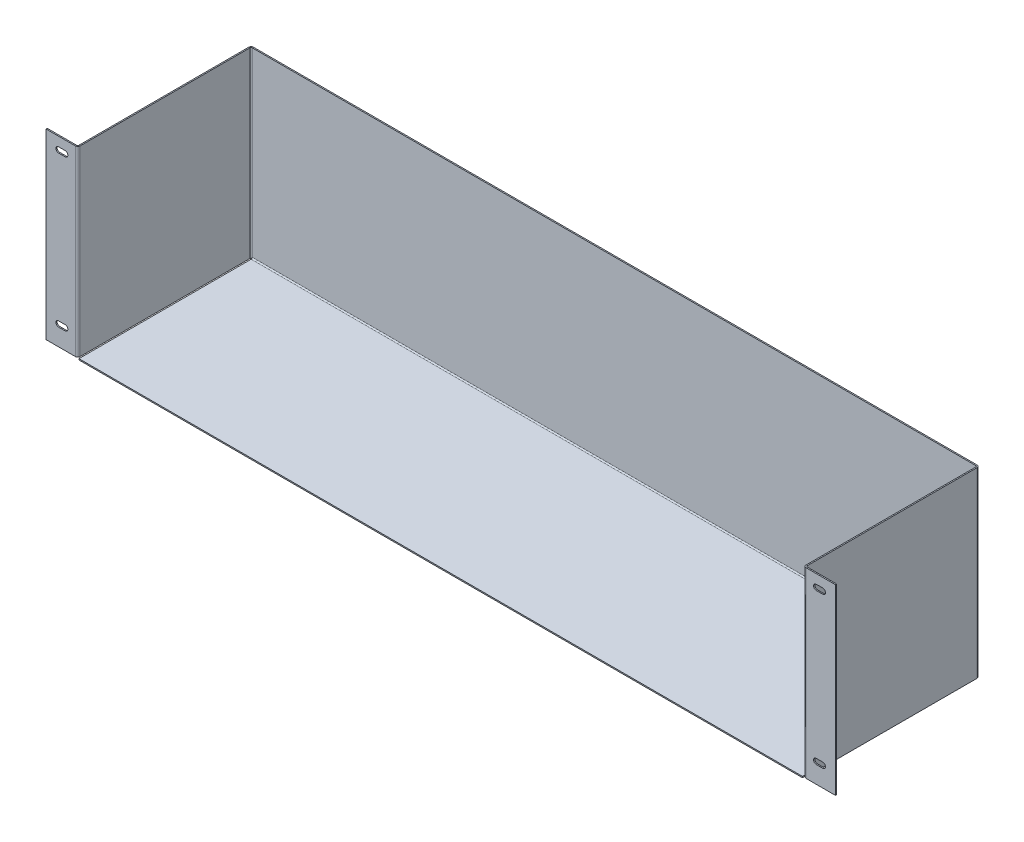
ISO-10303-21;
HEADER;
FILE_DESCRIPTION(('STEP AP214'),'2;1');
FILE_NAME('part.step','',(''),(''),'','','');
FILE_SCHEMA(('AUTOMOTIVE_DESIGN { 1 0 10303 214 1 1 1 1 }'));
ENDSEC;
DATA;
#1=APPLICATION_CONTEXT('core data for automotive mechanical design processes');
#2=APPLICATION_PROTOCOL_DEFINITION('international standard','automotive_design',2000,#1);
#3=PRODUCT_CONTEXT('',#1,'mechanical');
#4=PRODUCT('Part','Part','',(#3));
#5=PRODUCT_RELATED_PRODUCT_CATEGORY('part','',(#4));
#6=PRODUCT_DEFINITION_FORMATION('','',#4);
#7=PRODUCT_DEFINITION_CONTEXT('part definition',#1,'design');
#8=PRODUCT_DEFINITION('design','',#6,#7);
#9=PRODUCT_DEFINITION_SHAPE('','',#8);
#10=(LENGTH_UNIT() NAMED_UNIT(*) SI_UNIT(.MILLI.,.METRE.));
#11=(NAMED_UNIT(*) PLANE_ANGLE_UNIT() SI_UNIT($,.RADIAN.));
#12=(NAMED_UNIT(*) SI_UNIT($,.STERADIAN.) SOLID_ANGLE_UNIT());
#13=UNCERTAINTY_MEASURE_WITH_UNIT(LENGTH_MEASURE(1.E-05),#10,'distance_accuracy_value','');
#14=(GEOMETRIC_REPRESENTATION_CONTEXT(3) GLOBAL_UNCERTAINTY_ASSIGNED_CONTEXT((#13)) GLOBAL_UNIT_ASSIGNED_CONTEXT((#10,
#11,#12)) REPRESENTATION_CONTEXT('',''));
#15=CARTESIAN_POINT('',(0.,0.,0.));
#16=DIRECTION('',(0.,0.,1.));
#17=DIRECTION('',(1.,0.,0.));
#18=AXIS2_PLACEMENT_3D('',#15,#16,#17);
#19=CARTESIAN_POINT('',(477.5,25.,217.000000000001));
#20=DIRECTION('',(0.,0.,-1.));
#21=DIRECTION('',(-1.,0.,0.));
#22=AXIS2_PLACEMENT_3D('',#19,#20,#21);
#23=CYLINDRICAL_SURFACE('',#22,3.45000000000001);
#24=CARTESIAN_POINT('',(477.5,25.,217.000000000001));
#25=DIRECTION('',(0.,0.,-1.));
#26=DIRECTION('',(-1.,0.,0.));
#27=AXIS2_PLACEMENT_3D('',#24,#25,#26);
#28=CIRCLE('',#27,3.45000000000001);
#29=CARTESIAN_POINT('',(476.914765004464,28.4,217.));
#30=VERTEX_POINT('',#29);
#31=CARTESIAN_POINT('',(478.085234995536,28.4,217.));
#32=VERTEX_POINT('',#31);
#33=EDGE_CURVE('E669',#30,#32,#28,.T.);
#34=ORIENTED_EDGE('',*,*,#33,.T.);
#35=DIRECTION('',(0.,0.,-1.));
#36=VECTOR('',#35,1.);
#37=CARTESIAN_POINT('',(478.085234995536,28.4,217.000000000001));
#38=LINE('',#37,#36);
#39=CARTESIAN_POINT('',(478.085234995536,28.4,218.5));
#40=VERTEX_POINT('',#39);
#41=EDGE_CURVE('E12',#32,#40,#38,.F.);
#42=ORIENTED_EDGE('',*,*,#41,.T.);
#43=CARTESIAN_POINT('',(477.5,25.,218.5));
#44=DIRECTION('',(0.,0.,-1.));
#45=DIRECTION('',(-1.,0.,0.));
#46=AXIS2_PLACEMENT_3D('',#43,#44,#45);
#47=CIRCLE('',#46,3.45000000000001);
#48=CARTESIAN_POINT('',(476.914765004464,28.4,218.5));
#49=VERTEX_POINT('',#48);
#50=EDGE_CURVE('E665',#49,#40,#47,.T.);
#51=ORIENTED_EDGE('',*,*,#50,.F.);
#52=DIRECTION('',(0.,0.,-1.));
#53=VECTOR('',#52,1.);
#54=CARTESIAN_POINT('',(476.914765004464,28.4,217.000000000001));
#55=LINE('',#54,#53);
#56=EDGE_CURVE('E87',#49,#30,#55,.T.);
#57=ORIENTED_EDGE('',*,*,#56,.T.);
#58=EDGE_LOOP('',(#34,#42,#51,#57));
#59=FACE_BOUND('',#58,.T.);
#60=ADVANCED_FACE('F78',(#59),#23,.F.);
#61=CARTESIAN_POINT('',(477.5,215.,217.000000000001));
#62=DIRECTION('',(0.,0.,-1.));
#63=DIRECTION('',(-1.,0.,0.));
#64=AXIS2_PLACEMENT_3D('',#61,#62,#63);
#65=CYLINDRICAL_SURFACE('',#64,3.45000000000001);
#66=CARTESIAN_POINT('',(477.5,215.,217.000000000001));
#67=DIRECTION('',(0.,0.,-1.));
#68=DIRECTION('',(-1.,0.,0.));
#69=AXIS2_PLACEMENT_3D('',#66,#67,#68);
#70=CIRCLE('',#69,3.45000000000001);
#71=CARTESIAN_POINT('',(476.914765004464,218.4,217.));
#72=VERTEX_POINT('',#71);
#73=CARTESIAN_POINT('',(478.085234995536,218.4,217.));
#74=VERTEX_POINT('',#73);
#75=EDGE_CURVE('E660',#72,#74,#70,.T.);
#76=ORIENTED_EDGE('',*,*,#75,.T.);
#77=DIRECTION('',(0.,0.,-1.));
#78=VECTOR('',#77,1.);
#79=CARTESIAN_POINT('',(478.085234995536,218.4,217.000000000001));
#80=LINE('',#79,#78);
#81=CARTESIAN_POINT('',(478.085234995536,218.4,218.5));
#82=VERTEX_POINT('',#81);
#83=EDGE_CURVE('E1100',#74,#82,#80,.F.);
#84=ORIENTED_EDGE('',*,*,#83,.T.);
#85=CARTESIAN_POINT('',(477.5,215.,218.5));
#86=DIRECTION('',(0.,0.,-1.));
#87=DIRECTION('',(-1.,0.,0.));
#88=AXIS2_PLACEMENT_3D('',#85,#86,#87);
#89=CIRCLE('',#88,3.45000000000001);
#90=CARTESIAN_POINT('',(476.914765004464,218.4,218.5));
#91=VERTEX_POINT('',#90);
#92=EDGE_CURVE('E655',#91,#82,#89,.T.);
#93=ORIENTED_EDGE('',*,*,#92,.F.);
#94=DIRECTION('',(0.,0.,-1.));
#95=VECTOR('',#94,1.);
#96=CARTESIAN_POINT('',(476.914765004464,218.4,217.000000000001));
#97=LINE('',#96,#95);
#98=EDGE_CURVE('E1096',#91,#72,#97,.T.);
#99=ORIENTED_EDGE('',*,*,#98,.T.);
#100=EDGE_LOOP('',(#76,#84,#93,#99));
#101=FACE_BOUND('',#100,.T.);
#102=ADVANCED_FACE('F1192',(#101),#65,.F.);
#103=CARTESIAN_POINT('',(-477.5,215.,217.000000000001));
#104=DIRECTION('',(0.,0.,-1.));
#105=DIRECTION('',(-1.,0.,0.));
#106=AXIS2_PLACEMENT_3D('',#103,#104,#105);
#107=CYLINDRICAL_SURFACE('',#106,3.45000000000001);
#108=CARTESIAN_POINT('',(-477.5,215.,217.000000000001));
#109=DIRECTION('',(0.,0.,-1.));
#110=DIRECTION('',(-1.,0.,0.));
#111=AXIS2_PLACEMENT_3D('',#108,#109,#110);
#112=CIRCLE('',#111,3.45000000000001);
#113=CARTESIAN_POINT('',(-478.085234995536,218.4,217.000000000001));
#114=VERTEX_POINT('',#113);
#115=CARTESIAN_POINT('',(-476.914765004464,218.4,217.000000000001));
#116=VERTEX_POINT('',#115);
#117=EDGE_CURVE('E679',#114,#116,#112,.T.);
#118=ORIENTED_EDGE('',*,*,#117,.T.);
#119=DIRECTION('',(0.,0.,-1.));
#120=VECTOR('',#119,1.);
#121=CARTESIAN_POINT('',(-476.914765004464,218.4,217.000000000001));
#122=LINE('',#121,#120);
#123=CARTESIAN_POINT('',(-476.914765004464,218.4,218.500000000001));
#124=VERTEX_POINT('',#123);
#125=EDGE_CURVE('E1084',#116,#124,#122,.F.);
#126=ORIENTED_EDGE('',*,*,#125,.T.);
#127=CARTESIAN_POINT('',(-477.5,215.,218.5));
#128=DIRECTION('',(0.,0.,-1.));
#129=DIRECTION('',(-1.,0.,0.));
#130=AXIS2_PLACEMENT_3D('',#127,#128,#129);
#131=CIRCLE('',#130,3.45000000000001);
#132=CARTESIAN_POINT('',(-478.085234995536,218.4,218.500000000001));
#133=VERTEX_POINT('',#132);
#134=EDGE_CURVE('E674',#133,#124,#131,.T.);
#135=ORIENTED_EDGE('',*,*,#134,.F.);
#136=DIRECTION('',(0.,0.,-1.));
#137=VECTOR('',#136,1.);
#138=CARTESIAN_POINT('',(-478.085234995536,218.4,217.000000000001));
#139=LINE('',#138,#137);
#140=EDGE_CURVE('E1080',#133,#114,#139,.T.);
#141=ORIENTED_EDGE('',*,*,#140,.T.);
#142=EDGE_LOOP('',(#118,#126,#135,#141));
#143=FACE_BOUND('',#142,.T.);
#144=ADVANCED_FACE('F1219',(#143),#107,.F.);
#145=CARTESIAN_POINT('',(-477.5,25.,217.000000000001));
#146=DIRECTION('',(0.,0.,-1.));
#147=DIRECTION('',(-1.,0.,0.));
#148=AXIS2_PLACEMENT_3D('',#145,#146,#147);
#149=CYLINDRICAL_SURFACE('',#148,3.45000000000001);
#150=CARTESIAN_POINT('',(-477.5,25.,217.000000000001));
#151=DIRECTION('',(0.,0.,-1.));
#152=DIRECTION('',(-1.,0.,0.));
#153=AXIS2_PLACEMENT_3D('',#150,#151,#152);
#154=CIRCLE('',#153,3.45000000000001);
#155=CARTESIAN_POINT('',(-478.085234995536,28.4,217.000000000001));
#156=VERTEX_POINT('',#155);
#157=CARTESIAN_POINT('',(-476.914765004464,28.4,217.000000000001));
#158=VERTEX_POINT('',#157);
#159=EDGE_CURVE('E689',#156,#158,#154,.T.);
#160=ORIENTED_EDGE('',*,*,#159,.T.);
#161=DIRECTION('',(0.,0.,-1.));
#162=VECTOR('',#161,1.);
#163=CARTESIAN_POINT('',(-476.914765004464,28.4,217.000000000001));
#164=LINE('',#163,#162);
#165=CARTESIAN_POINT('',(-476.914765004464,28.4,218.500000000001));
#166=VERTEX_POINT('',#165);
#167=EDGE_CURVE('E1068',#158,#166,#164,.F.);
#168=ORIENTED_EDGE('',*,*,#167,.T.);
#169=CARTESIAN_POINT('',(-477.5,25.,218.5));
#170=DIRECTION('',(0.,0.,-1.));
#171=DIRECTION('',(-1.,0.,0.));
#172=AXIS2_PLACEMENT_3D('',#169,#170,#171);
#173=CIRCLE('',#172,3.45000000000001);
#174=CARTESIAN_POINT('',(-478.085234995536,28.4,218.500000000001));
#175=VERTEX_POINT('',#174);
#176=EDGE_CURVE('E684',#175,#166,#173,.T.);
#177=ORIENTED_EDGE('',*,*,#176,.F.);
#178=DIRECTION('',(0.,0.,-1.));
#179=VECTOR('',#178,1.);
#180=CARTESIAN_POINT('',(-478.085234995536,28.4,217.000000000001));
#181=LINE('',#180,#179);
#182=EDGE_CURVE('E1064',#175,#156,#181,.T.);
#183=ORIENTED_EDGE('',*,*,#182,.T.);
#184=EDGE_LOOP('',(#160,#168,#177,#183));
#185=FACE_BOUND('',#184,.T.);
#186=ADVANCED_FACE('F1300',(#185),#149,.F.);
#187=CARTESIAN_POINT('',(456.,0.,0.));
#188=DIRECTION('',(-1.,0.,0.));
#189=DIRECTION('',(0.,-1.,0.));
#190=AXIS2_PLACEMENT_3D('',#187,#188,#189);
#191=PLANE('',#190);
#192=DIRECTION('',(0.,0.,1.));
#193=VECTOR('',#192,1.);
#194=CARTESIAN_POINT('',(456.,0.,-1.5));
#195=LINE('',#194,#193);
#196=CARTESIAN_POINT('',(456.,0.,-1.5));
#197=VERTEX_POINT('',#196);
#198=CARTESIAN_POINT('',(456.,0.,-1.09807621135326));
#199=VERTEX_POINT('',#198);
#200=EDGE_CURVE('E1017',#197,#199,#195,.T.);
#201=ORIENTED_EDGE('',*,*,#200,.T.);
#202=CARTESIAN_POINT('',(456.,1.50000000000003,1.5));
#203=DIRECTION('',(1.,0.,0.));
#204=DIRECTION('',(0.,1.,0.));
#205=AXIS2_PLACEMENT_3D('',#202,#203,#204);
#206=CIRCLE('',#205,2.99999999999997);
#207=CARTESIAN_POINT('',(456.,1.50000000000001,-1.5));
#208=VERTEX_POINT('',#207);
#209=EDGE_CURVE('E762',#199,#208,#206,.T.);
#210=ORIENTED_EDGE('',*,*,#209,.T.);
#211=DIRECTION('',(0.,1.,0.));
#212=VECTOR('',#211,1.);
#213=CARTESIAN_POINT('',(455.999999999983,230.000000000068,-1.5));
#214=LINE('',#213,#212);
#215=EDGE_CURVE('E767',#197,#208,#214,.T.);
#216=ORIENTED_EDGE('',*,*,#215,.F.);
#217=EDGE_LOOP('',(#201,#210,#216));
#218=FACE_BOUND('',#217,.T.);
#219=ADVANCED_FACE('F1296',(#218),#191,.T.);
#220=CARTESIAN_POINT('',(-456.,1.49999999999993,0.));
#221=DIRECTION('',(1.,0.,0.));
#222=DIRECTION('',(0.,0.,-1.));
#223=AXIS2_PLACEMENT_3D('',#220,#221,#222);
#224=PLANE('',#223);
#225=DIRECTION('',(0.,-1.,0.));
#226=VECTOR('',#225,1.);
#227=CARTESIAN_POINT('',(-456.,230.,-1.5));
#228=LINE('',#227,#226);
#229=CARTESIAN_POINT('',(-456.,1.49999999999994,-1.5));
#230=VERTEX_POINT('',#229);
#231=CARTESIAN_POINT('',(-456.,0.,-1.5));
#232=VERTEX_POINT('',#231);
#233=EDGE_CURVE('E774',#230,#232,#228,.T.);
#234=ORIENTED_EDGE('',*,*,#233,.F.);
#235=CARTESIAN_POINT('',(-456.,1.49999999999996,1.5));
#236=DIRECTION('',(1.,0.,0.));
#237=DIRECTION('',(0.,1.,0.));
#238=AXIS2_PLACEMENT_3D('',#235,#236,#237);
#239=CIRCLE('',#238,2.99999999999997);
#240=CARTESIAN_POINT('',(-456.,0.,-1.0980762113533));
#241=VERTEX_POINT('',#240);
#242=EDGE_CURVE('E754',#230,#241,#239,.F.);
#243=ORIENTED_EDGE('',*,*,#242,.T.);
#244=DIRECTION('',(0.,0.,-1.));
#245=VECTOR('',#244,1.);
#246=CARTESIAN_POINT('',(-456.,0.,0.));
#247=LINE('',#246,#245);
#248=EDGE_CURVE('E1033',#241,#232,#247,.T.);
#249=ORIENTED_EDGE('',*,*,#248,.T.);
#250=EDGE_LOOP('',(#234,#243,#249));
#251=FACE_BOUND('',#250,.T.);
#252=ADVANCED_FACE('F1292',(#251),#224,.T.);
#253=CARTESIAN_POINT('',(-457.5,230.,-1.5));
#254=DIRECTION('',(0.,0.,-1.));
#255=DIRECTION('',(-1.,0.,0.));
#256=AXIS2_PLACEMENT_3D('',#253,#254,#255);
#257=PLANE('',#256);
#258=DIRECTION('',(0.,-1.,0.));
#259=VECTOR('',#258,1.);
#260=CARTESIAN_POINT('',(456.,230.,-1.5));
#261=LINE('',#260,#259);
#262=CARTESIAN_POINT('',(456.,230.,-1.5));
#263=VERTEX_POINT('',#262);
#264=EDGE_CURVE('E983',#263,#208,#261,.T.);
#265=ORIENTED_EDGE('',*,*,#264,.T.);
#266=DIRECTION('',(1.,0.,0.));
#267=VECTOR('',#266,1.);
#268=CARTESIAN_POINT('',(456.,1.49999999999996,-1.49999999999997));
#269=LINE('',#268,#267);
#270=EDGE_CURVE('E749',#208,#230,#269,.F.);
#271=ORIENTED_EDGE('',*,*,#270,.T.);
#272=DIRECTION('',(0.,-1.,0.));
#273=VECTOR('',#272,1.);
#274=CARTESIAN_POINT('',(-456.,230.,-1.5));
#275=LINE('',#274,#273);
#276=CARTESIAN_POINT('',(-456.,230.,-1.5));
#277=VERTEX_POINT('',#276);
#278=EDGE_CURVE('E979',#277,#230,#275,.T.);
#279=ORIENTED_EDGE('',*,*,#278,.F.);
#280=DIRECTION('',(1.,0.,0.));
#281=VECTOR('',#280,1.);
#282=CARTESIAN_POINT('',(-457.5,230.,-1.5));
#283=LINE('',#282,#281);
#284=EDGE_CURVE('E873',#277,#263,#283,.T.);
#285=ORIENTED_EDGE('',*,*,#284,.T.);
#286=EDGE_LOOP('',(#265,#271,#279,#285));
#287=FACE_BOUND('',#286,.T.);
#288=ADVANCED_FACE('F1295',(#287),#257,.T.);
#289=CARTESIAN_POINT('',(-457.5,230.,0.));
#290=DIRECTION('',(0.,0.,-1.));
#291=DIRECTION('',(-1.,0.,0.));
#292=AXIS2_PLACEMENT_3D('',#289,#290,#291);
#293=PLANE('',#292);
#294=DIRECTION('',(1.,0.,0.));
#295=VECTOR('',#294,1.);
#296=CARTESIAN_POINT('',(456.,1.5,0.));
#297=LINE('',#296,#295);
#298=CARTESIAN_POINT('',(456.,1.5,0.));
#299=VERTEX_POINT('',#298);
#300=CARTESIAN_POINT('',(-456.,1.49999999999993,0.));
#301=VERTEX_POINT('',#300);
#302=EDGE_CURVE('E742',#299,#301,#297,.F.);
#303=ORIENTED_EDGE('',*,*,#302,.F.);
#304=DIRECTION('',(0.,-1.,0.));
#305=VECTOR('',#304,1.);
#306=CARTESIAN_POINT('',(456.,230.,0.));
#307=LINE('',#306,#305);
#308=CARTESIAN_POINT('',(456.,230.,0.));
#309=VERTEX_POINT('',#308);
#310=EDGE_CURVE('E941',#309,#299,#307,.T.);
#311=ORIENTED_EDGE('',*,*,#310,.F.);
#312=DIRECTION('',(1.,0.,0.));
#313=VECTOR('',#312,1.);
#314=CARTESIAN_POINT('',(-457.5,230.,0.));
#315=LINE('',#314,#313);
#316=CARTESIAN_POINT('',(-456.,230.,0.));
#317=VERTEX_POINT('',#316);
#318=EDGE_CURVE('E913',#317,#309,#315,.T.);
#319=ORIENTED_EDGE('',*,*,#318,.F.);
#320=DIRECTION('',(0.,-1.,0.));
#321=VECTOR('',#320,1.);
#322=CARTESIAN_POINT('',(-456.,230.,0.));
#323=LINE('',#322,#321);
#324=EDGE_CURVE('E945',#317,#301,#323,.T.);
#325=ORIENTED_EDGE('',*,*,#324,.T.);
#326=EDGE_LOOP('',(#303,#311,#319,#325));
#327=FACE_BOUND('',#326,.T.);
#328=ADVANCED_FACE('F1322',(#327),#293,.F.);
#329=CARTESIAN_POINT('',(-460.5,230.,218.5));
#330=DIRECTION('',(0.,1.,0.));
#331=DIRECTION('',(0.,0.,1.));
#332=AXIS2_PLACEMENT_3D('',#329,#330,#331);
#333=PLANE('',#332);
#334=DIRECTION('',(0.,0.,-1.));
#335=VECTOR('',#334,1.);
#336=CARTESIAN_POINT('',(-460.5,230.,218.5));
#337=LINE('',#336,#335);
#338=CARTESIAN_POINT('',(-460.5,230.,218.5));
#339=VERTEX_POINT('',#338);
#340=CARTESIAN_POINT('',(-460.5,230.,217.));
#341=VERTEX_POINT('',#340);
#342=EDGE_CURVE('E1053',#339,#341,#337,.T.);
#343=ORIENTED_EDGE('',*,*,#342,.F.);
#344=CARTESIAN_POINT('',(-460.5,230.,215.5));
#345=DIRECTION('',(0.,-1.,0.));
#346=DIRECTION('',(0.,0.,-1.));
#347=AXIS2_PLACEMENT_3D('',#344,#345,#346);
#348=CIRCLE('',#347,3.);
#349=CARTESIAN_POINT('',(-457.5,230.,215.5));
#350=VERTEX_POINT('',#349);
#351=EDGE_CURVE('E901',#339,#350,#348,.F.);
#352=ORIENTED_EDGE('',*,*,#351,.T.);
#353=DIRECTION('',(1.,0.,0.));
#354=VECTOR('',#353,1.);
#355=CARTESIAN_POINT('',(-459.,230.,215.5));
#356=LINE('',#355,#354);
#357=CARTESIAN_POINT('',(-459.,230.,215.5));
#358=VERTEX_POINT('',#357);
#359=EDGE_CURVE('E1050',#358,#350,#356,.T.);
#360=ORIENTED_EDGE('',*,*,#359,.F.);
#361=CARTESIAN_POINT('',(-460.5,230.,215.5));
#362=DIRECTION('',(0.,1.,0.));
#363=DIRECTION('',(1.,0.,0.));
#364=AXIS2_PLACEMENT_3D('',#361,#362,#363);
#365=CIRCLE('',#364,1.5);
#366=EDGE_CURVE('E885',#341,#358,#365,.T.);
#367=ORIENTED_EDGE('',*,*,#366,.F.);
#368=EDGE_LOOP('',(#343,#352,#360,#367));
#369=FACE_BOUND('',#368,.T.);
#370=ADVANCED_FACE('F80',(#369),#333,.T.);
#371=CARTESIAN_POINT('',(-459.,230.,215.5));
#372=DIRECTION('',(0.,1.,0.));
#373=DIRECTION('',(0.,0.,1.));
#374=AXIS2_PLACEMENT_3D('',#371,#372,#373);
#375=PLANE('',#374);
#376=DIRECTION('',(1.,0.,0.));
#377=VECTOR('',#376,1.);
#378=CARTESIAN_POINT('',(-497.5,230.,218.5));
#379=LINE('',#378,#377);
#380=CARTESIAN_POINT('',(-497.5,230.,218.5));
#381=VERTEX_POINT('',#380);
#382=EDGE_CURVE('E897',#381,#339,#379,.T.);
#383=ORIENTED_EDGE('',*,*,#382,.T.);
#384=ORIENTED_EDGE('',*,*,#342,.T.);
#385=DIRECTION('',(1.,0.,0.));
#386=VECTOR('',#385,1.);
#387=CARTESIAN_POINT('',(-497.5,230.,217.));
#388=LINE('',#387,#386);
#389=CARTESIAN_POINT('',(-497.5,230.,217.));
#390=VERTEX_POINT('',#389);
#391=EDGE_CURVE('E889',#390,#341,#388,.T.);
#392=ORIENTED_EDGE('',*,*,#391,.F.);
#393=DIRECTION('',(0.,0.,-1.));
#394=VECTOR('',#393,1.);
#395=CARTESIAN_POINT('',(-497.5,230.,218.5));
#396=LINE('',#395,#394);
#397=EDGE_CURVE('E893',#381,#390,#396,.T.);
#398=ORIENTED_EDGE('',*,*,#397,.F.);
#399=EDGE_LOOP('',(#383,#384,#392,#398));
#400=FACE_BOUND('',#399,.T.);
#401=ADVANCED_FACE('F1430',(#400),#375,.T.);
#402=CARTESIAN_POINT('',(-457.5,0.,215.5));
#403=DIRECTION('',(0.,-1.,0.));
#404=DIRECTION('',(0.,0.,-1.));
#405=AXIS2_PLACEMENT_3D('',#402,#403,#404);
#406=PLANE('',#405);
#407=DIRECTION('',(-1.,0.,0.));
#408=VECTOR('',#407,1.);
#409=CARTESIAN_POINT('',(-457.5,0.,215.5));
#410=LINE('',#409,#408);
#411=CARTESIAN_POINT('',(-457.5,0.,215.5));
#412=VERTEX_POINT('',#411);
#413=CARTESIAN_POINT('',(-459.,0.,215.5));
#414=VERTEX_POINT('',#413);
#415=EDGE_CURVE('E1047',#412,#414,#410,.T.);
#416=ORIENTED_EDGE('',*,*,#415,.F.);
#417=CARTESIAN_POINT('',(-460.5,0.,215.5));
#418=DIRECTION('',(0.,-1.,0.));
#419=DIRECTION('',(0.,0.,-1.));
#420=AXIS2_PLACEMENT_3D('',#417,#418,#419);
#421=CIRCLE('',#420,3.);
#422=CARTESIAN_POINT('',(-460.5,0.,218.5));
#423=VERTEX_POINT('',#422);
#424=EDGE_CURVE('E826',#423,#412,#421,.F.);
#425=ORIENTED_EDGE('',*,*,#424,.F.);
#426=DIRECTION('',(0.,0.,1.));
#427=VECTOR('',#426,1.);
#428=CARTESIAN_POINT('',(-460.5,0.,217.));
#429=LINE('',#428,#427);
#430=CARTESIAN_POINT('',(-460.5,0.,217.));
#431=VERTEX_POINT('',#430);
#432=EDGE_CURVE('E1044',#431,#423,#429,.T.);
#433=ORIENTED_EDGE('',*,*,#432,.F.);
#434=CARTESIAN_POINT('',(-460.5,0.,215.5));
#435=DIRECTION('',(0.,1.,0.));
#436=DIRECTION('',(1.,0.,0.));
#437=AXIS2_PLACEMENT_3D('',#434,#435,#436);
#438=CIRCLE('',#437,1.5);
#439=EDGE_CURVE('E810',#431,#414,#438,.T.);
#440=ORIENTED_EDGE('',*,*,#439,.T.);
#441=EDGE_LOOP('',(#416,#425,#433,#440));
#442=FACE_BOUND('',#441,.T.);
#443=ADVANCED_FACE('F1427',(#442),#406,.T.);
#444=CARTESIAN_POINT('',(-460.5,0.,217.));
#445=DIRECTION('',(0.,-1.,0.));
#446=DIRECTION('',(0.,0.,-1.));
#447=AXIS2_PLACEMENT_3D('',#444,#445,#446);
#448=PLANE('',#447);
#449=DIRECTION('',(0.,0.,-1.));
#450=VECTOR('',#449,1.);
#451=CARTESIAN_POINT('',(-457.5,0.,218.5));
#452=LINE('',#451,#450);
#453=CARTESIAN_POINT('',(-457.5,0.,1.5));
#454=VERTEX_POINT('',#453);
#455=EDGE_CURVE('E830',#412,#454,#452,.T.);
#456=ORIENTED_EDGE('',*,*,#455,.F.);
#457=ORIENTED_EDGE('',*,*,#415,.T.);
#458=DIRECTION('',(0.,0.,-1.));
#459=VECTOR('',#458,1.);
#460=CARTESIAN_POINT('',(-459.,0.,218.5));
#461=LINE('',#460,#459);
#462=CARTESIAN_POINT('',(-459.,0.,1.5));
#463=VERTEX_POINT('',#462);
#464=EDGE_CURVE('E806',#414,#463,#461,.T.);
#465=ORIENTED_EDGE('',*,*,#464,.T.);
#466=DIRECTION('',(1.,0.,0.));
#467=VECTOR('',#466,1.);
#468=CARTESIAN_POINT('',(-459.,0.,1.5));
#469=LINE('',#468,#467);
#470=EDGE_CURVE('E1030',#463,#454,#469,.T.);
#471=ORIENTED_EDGE('',*,*,#470,.T.);
#472=EDGE_LOOP('',(#456,#457,#465,#471));
#473=FACE_BOUND('',#472,.T.);
#474=ADVANCED_FACE('F1423',(#473),#448,.T.);
#475=CARTESIAN_POINT('',(-457.5,230.,1.5));
#476=DIRECTION('',(0.,1.,0.));
#477=DIRECTION('',(0.,0.,1.));
#478=AXIS2_PLACEMENT_3D('',#475,#476,#477);
#479=PLANE('',#478);
#480=DIRECTION('',(-1.,0.,0.));
#481=VECTOR('',#480,1.);
#482=CARTESIAN_POINT('',(-457.5,230.,1.5));
#483=LINE('',#482,#481);
#484=CARTESIAN_POINT('',(-457.5,230.,1.5));
#485=VERTEX_POINT('',#484);
#486=CARTESIAN_POINT('',(-459.,230.,1.5));
#487=VERTEX_POINT('',#486);
#488=EDGE_CURVE('E1041',#485,#487,#483,.T.);
#489=ORIENTED_EDGE('',*,*,#488,.F.);
#490=CARTESIAN_POINT('',(-456.,230.,1.5));
#491=DIRECTION('',(0.,1.,0.));
#492=DIRECTION('',(0.,0.,1.));
#493=AXIS2_PLACEMENT_3D('',#490,#491,#492);
#494=CIRCLE('',#493,1.5);
#495=EDGE_CURVE('E909',#485,#317,#494,.F.);
#496=ORIENTED_EDGE('',*,*,#495,.T.);
#497=DIRECTION('',(0.,0.,1.));
#498=VECTOR('',#497,1.);
#499=CARTESIAN_POINT('',(-456.,230.,-1.5));
#500=LINE('',#499,#498);
#501=EDGE_CURVE('E1038',#277,#317,#500,.T.);
#502=ORIENTED_EDGE('',*,*,#501,.F.);
#503=CARTESIAN_POINT('',(-456.,230.,1.5));
#504=DIRECTION('',(0.,1.,0.));
#505=DIRECTION('',(1.,0.,0.));
#506=AXIS2_PLACEMENT_3D('',#503,#504,#505);
#507=CIRCLE('',#506,3.);
#508=EDGE_CURVE('E877',#487,#277,#507,.F.);
#509=ORIENTED_EDGE('',*,*,#508,.F.);
#510=EDGE_LOOP('',(#489,#496,#502,#509));
#511=FACE_BOUND('',#510,.T.);
#512=ADVANCED_FACE('F1419',(#511),#479,.T.);
#513=CARTESIAN_POINT('',(-456.,230.,-1.5));
#514=DIRECTION('',(0.,1.,0.));
#515=DIRECTION('',(0.,0.,1.));
#516=AXIS2_PLACEMENT_3D('',#513,#514,#515);
#517=PLANE('',#516);
#518=DIRECTION('',(0.,0.,-1.));
#519=VECTOR('',#518,1.);
#520=CARTESIAN_POINT('',(-457.5,230.,218.5));
#521=LINE('',#520,#519);
#522=EDGE_CURVE('E905',#350,#485,#521,.T.);
#523=ORIENTED_EDGE('',*,*,#522,.T.);
#524=ORIENTED_EDGE('',*,*,#488,.T.);
#525=DIRECTION('',(0.,0.,-1.));
#526=VECTOR('',#525,1.);
#527=CARTESIAN_POINT('',(-459.,230.,218.5));
#528=LINE('',#527,#526);
#529=EDGE_CURVE('E881',#358,#487,#528,.T.);
#530=ORIENTED_EDGE('',*,*,#529,.F.);
#531=ORIENTED_EDGE('',*,*,#359,.T.);
#532=EDGE_LOOP('',(#523,#524,#530,#531));
#533=FACE_BOUND('',#532,.T.);
#534=ADVANCED_FACE('F1415',(#533),#517,.T.);
#535=CARTESIAN_POINT('',(-456.,0.,0.));
#536=DIRECTION('',(0.,-1.,0.));
#537=DIRECTION('',(0.,0.,-1.));
#538=AXIS2_PLACEMENT_3D('',#535,#536,#537);
#539=PLANE('',#538);
#540=CARTESIAN_POINT('',(-456.,0.,0.));
#541=VERTEX_POINT('',#540);
#542=EDGE_CURVE('E1034',#541,#241,#247,.T.);
#543=ORIENTED_EDGE('',*,*,#542,.F.);
#544=CARTESIAN_POINT('',(-456.,0.,1.5));
#545=DIRECTION('',(0.,1.,0.));
#546=DIRECTION('',(0.,0.,1.));
#547=AXIS2_PLACEMENT_3D('',#544,#545,#546);
#548=CIRCLE('',#547,1.5);
#549=EDGE_CURVE('E834',#454,#541,#548,.F.);
#550=ORIENTED_EDGE('',*,*,#549,.F.);
#551=ORIENTED_EDGE('',*,*,#470,.F.);
#552=CARTESIAN_POINT('',(-456.,0.,1.5));
#553=DIRECTION('',(0.,1.,0.));
#554=DIRECTION('',(1.,0.,0.));
#555=AXIS2_PLACEMENT_3D('',#552,#553,#554);
#556=CIRCLE('',#555,3.);
#557=EDGE_CURVE('E802',#463,#232,#556,.F.);
#558=ORIENTED_EDGE('',*,*,#557,.T.);
#559=ORIENTED_EDGE('',*,*,#248,.F.);
#560=EDGE_LOOP('',(#543,#550,#551,#558,#559));
#561=FACE_BOUND('',#560,.T.);
#562=ADVANCED_FACE('F1411',(#561),#539,.T.);
#563=CARTESIAN_POINT('',(456.,230.,0.));
#564=DIRECTION('',(0.,1.,0.));
#565=DIRECTION('',(0.,0.,1.));
#566=AXIS2_PLACEMENT_3D('',#563,#564,#565);
#567=PLANE('',#566);
#568=DIRECTION('',(0.,0.,-1.));
#569=VECTOR('',#568,1.);
#570=CARTESIAN_POINT('',(456.,230.,0.));
#571=LINE('',#570,#569);
#572=EDGE_CURVE('E1027',#309,#263,#571,.T.);
#573=ORIENTED_EDGE('',*,*,#572,.F.);
#574=CARTESIAN_POINT('',(456.,230.,1.5));
#575=DIRECTION('',(0.,1.,0.));
#576=DIRECTION('',(0.,0.,1.));
#577=AXIS2_PLACEMENT_3D('',#574,#575,#576);
#578=CIRCLE('',#577,1.5);
#579=CARTESIAN_POINT('',(457.5,230.,1.5));
#580=VERTEX_POINT('',#579);
#581=EDGE_CURVE('E917',#309,#580,#578,.F.);
#582=ORIENTED_EDGE('',*,*,#581,.T.);
#583=DIRECTION('',(-1.,0.,0.));
#584=VECTOR('',#583,1.);
#585=CARTESIAN_POINT('',(459.,230.,1.5));
#586=LINE('',#585,#584);
#587=CARTESIAN_POINT('',(459.,230.,1.5));
#588=VERTEX_POINT('',#587);
#589=EDGE_CURVE('E1024',#588,#580,#586,.T.);
#590=ORIENTED_EDGE('',*,*,#589,.F.);
#591=CARTESIAN_POINT('',(456.,230.,1.5));
#592=DIRECTION('',(0.,1.,0.));
#593=DIRECTION('',(1.,0.,0.));
#594=AXIS2_PLACEMENT_3D('',#591,#592,#593);
#595=CIRCLE('',#594,3.);
#596=EDGE_CURVE('E869',#263,#588,#595,.F.);
#597=ORIENTED_EDGE('',*,*,#596,.F.);
#598=EDGE_LOOP('',(#573,#582,#590,#597));
#599=FACE_BOUND('',#598,.T.);
#600=ADVANCED_FACE('F1407',(#599),#567,.T.);
#601=CARTESIAN_POINT('',(459.,230.,1.5));
#602=DIRECTION('',(0.,1.,0.));
#603=DIRECTION('',(0.,0.,1.));
#604=AXIS2_PLACEMENT_3D('',#601,#602,#603);
#605=PLANE('',#604);
#606=ORIENTED_EDGE('',*,*,#318,.T.);
#607=ORIENTED_EDGE('',*,*,#572,.T.);
#608=ORIENTED_EDGE('',*,*,#284,.F.);
#609=ORIENTED_EDGE('',*,*,#501,.T.);
#610=EDGE_LOOP('',(#606,#607,#608,#609));
#611=FACE_BOUND('',#610,.T.);
#612=ADVANCED_FACE('F1403',(#611),#605,.T.);
#613=CARTESIAN_POINT('',(457.5,0.,1.5));
#614=DIRECTION('',(0.,-1.,0.));
#615=DIRECTION('',(0.,0.,-1.));
#616=AXIS2_PLACEMENT_3D('',#613,#614,#615);
#617=PLANE('',#616);
#618=DIRECTION('',(1.,0.,0.));
#619=VECTOR('',#618,1.);
#620=CARTESIAN_POINT('',(457.5,0.,1.5));
#621=LINE('',#620,#619);
#622=CARTESIAN_POINT('',(457.5,0.,1.5));
#623=VERTEX_POINT('',#622);
#624=CARTESIAN_POINT('',(459.,0.,1.5));
#625=VERTEX_POINT('',#624);
#626=EDGE_CURVE('E1021',#623,#625,#621,.T.);
#627=ORIENTED_EDGE('',*,*,#626,.F.);
#628=CARTESIAN_POINT('',(456.,0.,1.5));
#629=DIRECTION('',(0.,1.,0.));
#630=DIRECTION('',(0.,0.,1.));
#631=AXIS2_PLACEMENT_3D('',#628,#629,#630);
#632=CIRCLE('',#631,1.5);
#633=CARTESIAN_POINT('',(456.,0.,0.));
#634=VERTEX_POINT('',#633);
#635=EDGE_CURVE('E838',#634,#623,#632,.F.);
#636=ORIENTED_EDGE('',*,*,#635,.F.);
#637=EDGE_CURVE('E1016',#199,#634,#195,.T.);
#638=ORIENTED_EDGE('',*,*,#637,.F.);
#639=ORIENTED_EDGE('',*,*,#200,.F.);
#640=CARTESIAN_POINT('',(456.,0.,1.5));
#641=DIRECTION('',(0.,1.,0.));
#642=DIRECTION('',(1.,0.,0.));
#643=AXIS2_PLACEMENT_3D('',#640,#641,#642);
#644=CIRCLE('',#643,3.);
#645=EDGE_CURVE('E798',#197,#625,#644,.F.);
#646=ORIENTED_EDGE('',*,*,#645,.T.);
#647=EDGE_LOOP('',(#627,#636,#638,#639,#646));
#648=FACE_BOUND('',#647,.T.);
#649=ADVANCED_FACE('F1399',(#648),#617,.T.);
#650=CARTESIAN_POINT('',(456.,0.,-1.5));
#651=DIRECTION('',(0.,-1.,0.));
#652=DIRECTION('',(0.,0.,-1.));
#653=AXIS2_PLACEMENT_3D('',#650,#651,#652);
#654=PLANE('',#653);
#655=DIRECTION('',(0.,0.,1.));
#656=VECTOR('',#655,1.);
#657=CARTESIAN_POINT('',(457.5,0.,0.));
#658=LINE('',#657,#656);
#659=CARTESIAN_POINT('',(457.5,0.,215.5));
#660=VERTEX_POINT('',#659);
#661=EDGE_CURVE('E842',#623,#660,#658,.T.);
#662=ORIENTED_EDGE('',*,*,#661,.F.);
#663=ORIENTED_EDGE('',*,*,#626,.T.);
#664=DIRECTION('',(0.,0.,1.));
#665=VECTOR('',#664,1.);
#666=CARTESIAN_POINT('',(459.,0.,0.));
#667=LINE('',#666,#665);
#668=CARTESIAN_POINT('',(459.,0.,215.5));
#669=VERTEX_POINT('',#668);
#670=EDGE_CURVE('E794',#625,#669,#667,.T.);
#671=ORIENTED_EDGE('',*,*,#670,.T.);
#672=DIRECTION('',(-1.,0.,0.));
#673=VECTOR('',#672,1.);
#674=CARTESIAN_POINT('',(459.,0.,215.5));
#675=LINE('',#674,#673);
#676=EDGE_CURVE('E1004',#669,#660,#675,.T.);
#677=ORIENTED_EDGE('',*,*,#676,.T.);
#678=EDGE_LOOP('',(#662,#663,#671,#677));
#679=FACE_BOUND('',#678,.T.);
#680=ADVANCED_FACE('F1395',(#679),#654,.T.);
#681=CARTESIAN_POINT('',(457.5,230.,215.5));
#682=DIRECTION('',(0.,1.,0.));
#683=DIRECTION('',(0.,0.,1.));
#684=AXIS2_PLACEMENT_3D('',#681,#682,#683);
#685=PLANE('',#684);
#686=DIRECTION('',(1.,0.,0.));
#687=VECTOR('',#686,1.);
#688=CARTESIAN_POINT('',(457.5,230.,215.5));
#689=LINE('',#688,#687);
#690=CARTESIAN_POINT('',(457.5,230.,215.5));
#691=VERTEX_POINT('',#690);
#692=CARTESIAN_POINT('',(459.,230.,215.5));
#693=VERTEX_POINT('',#692);
#694=EDGE_CURVE('E1013',#691,#693,#689,.T.);
#695=ORIENTED_EDGE('',*,*,#694,.F.);
#696=CARTESIAN_POINT('',(460.5,230.,215.5));
#697=DIRECTION('',(0.,-1.,0.));
#698=DIRECTION('',(0.,0.,-1.));
#699=AXIS2_PLACEMENT_3D('',#696,#697,#698);
#700=CIRCLE('',#699,3.);
#701=CARTESIAN_POINT('',(460.5,230.,218.5));
#702=VERTEX_POINT('',#701);
#703=EDGE_CURVE('E925',#691,#702,#700,.F.);
#704=ORIENTED_EDGE('',*,*,#703,.T.);
#705=DIRECTION('',(0.,0.,1.));
#706=VECTOR('',#705,1.);
#707=CARTESIAN_POINT('',(460.5,230.,217.));
#708=LINE('',#707,#706);
#709=CARTESIAN_POINT('',(460.5,230.,217.));
#710=VERTEX_POINT('',#709);
#711=EDGE_CURVE('E1010',#710,#702,#708,.T.);
#712=ORIENTED_EDGE('',*,*,#711,.F.);
#713=CARTESIAN_POINT('',(460.5,230.,215.5));
#714=DIRECTION('',(0.,1.,0.));
#715=DIRECTION('',(1.,0.,0.));
#716=AXIS2_PLACEMENT_3D('',#713,#714,#715);
#717=CIRCLE('',#716,1.5);
#718=EDGE_CURVE('E861',#693,#710,#717,.T.);
#719=ORIENTED_EDGE('',*,*,#718,.F.);
#720=EDGE_LOOP('',(#695,#704,#712,#719));
#721=FACE_BOUND('',#720,.T.);
#722=ADVANCED_FACE('F1391',(#721),#685,.T.);
#723=CARTESIAN_POINT('',(460.5,230.,217.));
#724=DIRECTION('',(0.,1.,0.));
#725=DIRECTION('',(0.,0.,1.));
#726=AXIS2_PLACEMENT_3D('',#723,#724,#725);
#727=PLANE('',#726);
#728=DIRECTION('',(0.,0.,1.));
#729=VECTOR('',#728,1.);
#730=CARTESIAN_POINT('',(457.5,230.,0.));
#731=LINE('',#730,#729);
#732=EDGE_CURVE('E921',#580,#691,#731,.T.);
#733=ORIENTED_EDGE('',*,*,#732,.T.);
#734=ORIENTED_EDGE('',*,*,#694,.T.);
#735=DIRECTION('',(0.,0.,1.));
#736=VECTOR('',#735,1.);
#737=CARTESIAN_POINT('',(459.,230.,0.));
#738=LINE('',#737,#736);
#739=EDGE_CURVE('E865',#588,#693,#738,.T.);
#740=ORIENTED_EDGE('',*,*,#739,.F.);
#741=ORIENTED_EDGE('',*,*,#589,.T.);
#742=EDGE_LOOP('',(#733,#734,#740,#741));
#743=FACE_BOUND('',#742,.T.);
#744=ADVANCED_FACE('F1387',(#743),#727,.T.);
#745=CARTESIAN_POINT('',(460.5,0.,218.5));
#746=DIRECTION('',(0.,-1.,0.));
#747=DIRECTION('',(0.,0.,-1.));
#748=AXIS2_PLACEMENT_3D('',#745,#746,#747);
#749=PLANE('',#748);
#750=DIRECTION('',(0.,0.,-1.));
#751=VECTOR('',#750,1.);
#752=CARTESIAN_POINT('',(460.5,0.,218.5));
#753=LINE('',#752,#751);
#754=CARTESIAN_POINT('',(460.5,0.,218.5));
#755=VERTEX_POINT('',#754);
#756=CARTESIAN_POINT('',(460.5,0.,217.));
#757=VERTEX_POINT('',#756);
#758=EDGE_CURVE('E1007',#755,#757,#753,.T.);
#759=ORIENTED_EDGE('',*,*,#758,.F.);
#760=CARTESIAN_POINT('',(460.5,0.,215.5));
#761=DIRECTION('',(0.,-1.,0.));
#762=DIRECTION('',(0.,0.,-1.));
#763=AXIS2_PLACEMENT_3D('',#760,#761,#762);
#764=CIRCLE('',#763,3.);
#765=EDGE_CURVE('E846',#660,#755,#764,.F.);
#766=ORIENTED_EDGE('',*,*,#765,.F.);
#767=ORIENTED_EDGE('',*,*,#676,.F.);
#768=CARTESIAN_POINT('',(460.5,0.,215.5));
#769=DIRECTION('',(0.,1.,0.));
#770=DIRECTION('',(1.,0.,0.));
#771=AXIS2_PLACEMENT_3D('',#768,#769,#770);
#772=CIRCLE('',#771,1.5);
#773=EDGE_CURVE('E790',#669,#757,#772,.T.);
#774=ORIENTED_EDGE('',*,*,#773,.T.);
#775=EDGE_LOOP('',(#759,#766,#767,#774));
#776=FACE_BOUND('',#775,.T.);
#777=ADVANCED_FACE('F1383',(#776),#749,.T.);
#778=CARTESIAN_POINT('',(459.,0.,215.5));
#779=DIRECTION('',(0.,-1.,0.));
#780=DIRECTION('',(0.,0.,-1.));
#781=AXIS2_PLACEMENT_3D('',#778,#779,#780);
#782=PLANE('',#781);
#783=DIRECTION('',(1.,0.,0.));
#784=VECTOR('',#783,1.);
#785=CARTESIAN_POINT('',(457.5,0.,218.5));
#786=LINE('',#785,#784);
#787=CARTESIAN_POINT('',(497.5,0.,218.5));
#788=VERTEX_POINT('',#787);
#789=EDGE_CURVE('E778',#755,#788,#786,.T.);
#790=ORIENTED_EDGE('',*,*,#789,.F.);
#791=ORIENTED_EDGE('',*,*,#758,.T.);
#792=DIRECTION('',(1.,0.,0.));
#793=VECTOR('',#792,1.);
#794=CARTESIAN_POINT('',(457.5,0.,217.));
#795=LINE('',#794,#793);
#796=CARTESIAN_POINT('',(497.5,0.,217.));
#797=VERTEX_POINT('',#796);
#798=EDGE_CURVE('E786',#757,#797,#795,.T.);
#799=ORIENTED_EDGE('',*,*,#798,.T.);
#800=DIRECTION('',(0.,0.,1.));
#801=VECTOR('',#800,1.);
#802=CARTESIAN_POINT('',(497.5,0.,217.));
#803=LINE('',#802,#801);
#804=EDGE_CURVE('E782',#797,#788,#803,.T.);
#805=ORIENTED_EDGE('',*,*,#804,.T.);
#806=EDGE_LOOP('',(#790,#791,#799,#805));
#807=FACE_BOUND('',#806,.T.);
#808=ADVANCED_FACE('F1380',(#807),#782,.T.);
#809=CARTESIAN_POINT('',(457.5,230.,218.5));
#810=DIRECTION('',(0.,0.,-1.));
#811=DIRECTION('',(-1.,0.,0.));
#812=AXIS2_PLACEMENT_3D('',#809,#810,#811);
#813=PLANE('',#812);
#814=ORIENTED_EDGE('',*,*,#92,.T.);
#815=DIRECTION('',(1.,0.,0.));
#816=VECTOR('',#815,1.);
#817=CARTESIAN_POINT('',(481.6,218.4,218.5));
#818=LINE('',#817,#816);
#819=CARTESIAN_POINT('',(481.6,218.4,218.5));
#820=VERTEX_POINT('',#819);
#821=EDGE_CURVE('E539',#82,#820,#818,.T.);
#822=ORIENTED_EDGE('',*,*,#821,.T.);
#823=CARTESIAN_POINT('',(481.6,215.,218.5));
#824=DIRECTION('',(0.,0.,-1.));
#825=DIRECTION('',(1.,0.,0.));
#826=AXIS2_PLACEMENT_3D('',#823,#824,#825);
#827=CIRCLE('',#826,3.39999999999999);
#828=CARTESIAN_POINT('',(481.6,211.6,218.5));
#829=VERTEX_POINT('',#828);
#830=EDGE_CURVE('E526',#820,#829,#827,.T.);
#831=ORIENTED_EDGE('',*,*,#830,.T.);
#832=DIRECTION('',(-1.,0.,0.));
#833=VECTOR('',#832,1.);
#834=CARTESIAN_POINT('',(481.6,211.6,218.5));
#835=LINE('',#834,#833);
#836=CARTESIAN_POINT('',(478.085234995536,211.6,218.5));
#837=VERTEX_POINT('',#836);
#838=EDGE_CURVE('E531',#829,#837,#835,.T.);
#839=ORIENTED_EDGE('',*,*,#838,.T.);
#840=CARTESIAN_POINT('',(476.914765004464,211.6,218.5));
#841=VERTEX_POINT('',#840);
#842=EDGE_CURVE('E645',#837,#841,#89,.T.);
#843=ORIENTED_EDGE('',*,*,#842,.T.);
#844=CARTESIAN_POINT('',(473.4,211.6,218.5));
#845=VERTEX_POINT('',#844);
#846=EDGE_CURVE('E530',#841,#845,#835,.T.);
#847=ORIENTED_EDGE('',*,*,#846,.T.);
#848=CARTESIAN_POINT('',(473.4,215.,218.5));
#849=DIRECTION('',(0.,0.,-1.));
#850=DIRECTION('',(-1.,0.,0.));
#851=AXIS2_PLACEMENT_3D('',#848,#849,#850);
#852=CIRCLE('',#851,3.39999999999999);
#853=CARTESIAN_POINT('',(473.4,218.4,218.5));
#854=VERTEX_POINT('',#853);
#855=EDGE_CURVE('E535',#845,#854,#852,.T.);
#856=ORIENTED_EDGE('',*,*,#855,.T.);
#857=EDGE_CURVE('E540',#854,#91,#818,.T.);
#858=ORIENTED_EDGE('',*,*,#857,.T.);
#859=EDGE_LOOP('',(#814,#822,#831,#839,#843,#847,#856,#858));
#860=FACE_BOUND('',#859,.T.);
#861=ORIENTED_EDGE('',*,*,#50,.T.);
#862=DIRECTION('',(1.,0.,0.));
#863=VECTOR('',#862,1.);
#864=CARTESIAN_POINT('',(481.6,28.4,218.5));
#865=LINE('',#864,#863);
#866=CARTESIAN_POINT('',(481.6,28.4,218.5));
#867=VERTEX_POINT('',#866);
#868=EDGE_CURVE('E499',#40,#867,#865,.T.);
#869=ORIENTED_EDGE('',*,*,#868,.T.);
#870=CARTESIAN_POINT('',(481.6,25.,218.5));
#871=DIRECTION('',(0.,0.,-1.));
#872=DIRECTION('',(1.,0.,0.));
#873=AXIS2_PLACEMENT_3D('',#870,#871,#872);
#874=CIRCLE('',#873,3.4);
#875=CARTESIAN_POINT('',(481.6,21.6,218.5));
#876=VERTEX_POINT('',#875);
#877=EDGE_CURVE('E490',#867,#876,#874,.T.);
#878=ORIENTED_EDGE('',*,*,#877,.T.);
#879=DIRECTION('',(-1.,0.,0.));
#880=VECTOR('',#879,1.);
#881=CARTESIAN_POINT('',(481.6,21.6,218.5));
#882=LINE('',#881,#880);
#883=CARTESIAN_POINT('',(478.085234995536,21.6,218.5));
#884=VERTEX_POINT('',#883);
#885=EDGE_CURVE('E452',#876,#884,#882,.T.);
#886=ORIENTED_EDGE('',*,*,#885,.T.);
#887=CARTESIAN_POINT('',(476.914765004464,21.6,218.5));
#888=VERTEX_POINT('',#887);
#889=EDGE_CURVE('E664',#884,#888,#47,.T.);
#890=ORIENTED_EDGE('',*,*,#889,.T.);
#891=CARTESIAN_POINT('',(473.4,21.6,218.5));
#892=VERTEX_POINT('',#891);
#893=EDGE_CURVE('E102',#888,#892,#882,.T.);
#894=ORIENTED_EDGE('',*,*,#893,.T.);
#895=CARTESIAN_POINT('',(473.4,25.,218.5));
#896=DIRECTION('',(0.,0.,-1.));
#897=DIRECTION('',(-1.,0.,0.));
#898=AXIS2_PLACEMENT_3D('',#895,#896,#897);
#899=CIRCLE('',#898,3.4);
#900=CARTESIAN_POINT('',(473.4,28.4,218.5));
#901=VERTEX_POINT('',#900);
#902=EDGE_CURVE('E495',#892,#901,#899,.T.);
#903=ORIENTED_EDGE('',*,*,#902,.T.);
#904=EDGE_CURVE('E458',#901,#49,#865,.T.);
#905=ORIENTED_EDGE('',*,*,#904,.T.);
#906=EDGE_LOOP('',(#861,#869,#878,#886,#890,#894,#903,#905));
#907=FACE_BOUND('',#906,.T.);
#908=ORIENTED_EDGE('',*,*,#789,.T.);
#909=DIRECTION('',(0.,-1.,0.));
#910=VECTOR('',#909,1.);
#911=CARTESIAN_POINT('',(497.5,230.,218.5));
#912=LINE('',#911,#910);
#913=CARTESIAN_POINT('',(497.5,230.,218.5));
#914=VERTEX_POINT('',#913);
#915=EDGE_CURVE('E1002',#914,#788,#912,.T.);
#916=ORIENTED_EDGE('',*,*,#915,.F.);
#917=DIRECTION('',(1.,0.,0.));
#918=VECTOR('',#917,1.);
#919=CARTESIAN_POINT('',(457.5,230.,218.5));
#920=LINE('',#919,#918);
#921=EDGE_CURVE('E850',#702,#914,#920,.T.);
#922=ORIENTED_EDGE('',*,*,#921,.F.);
#923=DIRECTION('',(0.,-1.,0.));
#924=VECTOR('',#923,1.);
#925=CARTESIAN_POINT('',(460.5,230.,218.5));
#926=LINE('',#925,#924);
#927=EDGE_CURVE('E929',#702,#755,#926,.T.);
#928=ORIENTED_EDGE('',*,*,#927,.T.);
#929=EDGE_LOOP('',(#908,#916,#922,#928));
#930=FACE_BOUND('',#929,.T.);
#931=ADVANCED_FACE('F1180',(#860,#907,#930),#813,.F.);
#932=CARTESIAN_POINT('',(497.5,230.,217.));
#933=DIRECTION('',(1.,0.,0.));
#934=DIRECTION('',(0.,0.,-1.));
#935=AXIS2_PLACEMENT_3D('',#932,#933,#934);
#936=PLANE('',#935);
#937=ORIENTED_EDGE('',*,*,#804,.F.);
#938=DIRECTION('',(0.,-1.,0.));
#939=VECTOR('',#938,1.);
#940=CARTESIAN_POINT('',(497.5,230.,217.));
#941=LINE('',#940,#939);
#942=CARTESIAN_POINT('',(497.5,230.,217.));
#943=VERTEX_POINT('',#942);
#944=EDGE_CURVE('E999',#943,#797,#941,.T.);
#945=ORIENTED_EDGE('',*,*,#944,.F.);
#946=DIRECTION('',(0.,0.,1.));
#947=VECTOR('',#946,1.);
#948=CARTESIAN_POINT('',(497.5,230.,217.));
#949=LINE('',#948,#947);
#950=EDGE_CURVE('E853',#943,#914,#949,.T.);
#951=ORIENTED_EDGE('',*,*,#950,.T.);
#952=ORIENTED_EDGE('',*,*,#915,.T.);
#953=EDGE_LOOP('',(#937,#945,#951,#952));
#954=FACE_BOUND('',#953,.T.);
#955=ADVANCED_FACE('F1374',(#954),#936,.T.);
#956=CARTESIAN_POINT('',(457.5,230.,217.));
#957=DIRECTION('',(0.,0.,-1.));
#958=DIRECTION('',(-1.,0.,0.));
#959=AXIS2_PLACEMENT_3D('',#956,#957,#958);
#960=PLANE('',#959);
#961=DIRECTION('',(1.,0.,0.));
#962=VECTOR('',#961,1.);
#963=CARTESIAN_POINT('',(481.6,28.4,217.));
#964=LINE('',#963,#962);
#965=CARTESIAN_POINT('',(481.6,28.4,217.));
#966=VERTEX_POINT('',#965);
#967=EDGE_CURVE('E483',#32,#966,#964,.T.);
#968=ORIENTED_EDGE('',*,*,#967,.F.);
#969=ORIENTED_EDGE('',*,*,#33,.F.);
#970=CARTESIAN_POINT('',(473.4,28.4,217.));
#971=VERTEX_POINT('',#970);
#972=EDGE_CURVE('E487',#971,#30,#964,.T.);
#973=ORIENTED_EDGE('',*,*,#972,.F.);
#974=CARTESIAN_POINT('',(473.4,25.,217.));
#975=DIRECTION('',(0.,0.,-1.));
#976=DIRECTION('',(-1.,0.,0.));
#977=AXIS2_PLACEMENT_3D('',#974,#975,#976);
#978=CIRCLE('',#977,3.4);
#979=CARTESIAN_POINT('',(473.4,21.6,217.));
#980=VERTEX_POINT('',#979);
#981=EDGE_CURVE('E477',#980,#971,#978,.T.);
#982=ORIENTED_EDGE('',*,*,#981,.F.);
#983=DIRECTION('',(-1.,0.,0.));
#984=VECTOR('',#983,1.);
#985=CARTESIAN_POINT('',(481.6,21.6,217.));
#986=LINE('',#985,#984);
#987=CARTESIAN_POINT('',(476.914765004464,21.6,217.));
#988=VERTEX_POINT('',#987);
#989=EDGE_CURVE('E468',#988,#980,#986,.T.);
#990=ORIENTED_EDGE('',*,*,#989,.F.);
#991=CARTESIAN_POINT('',(478.085234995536,21.6,217.000000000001));
#992=VERTEX_POINT('',#991);
#993=EDGE_CURVE('E475',#992,#988,#28,.T.);
#994=ORIENTED_EDGE('',*,*,#993,.F.);
#995=CARTESIAN_POINT('',(481.6,21.6,217.));
#996=VERTEX_POINT('',#995);
#997=EDGE_CURVE('E94',#996,#992,#986,.T.);
#998=ORIENTED_EDGE('',*,*,#997,.F.);
#999=CARTESIAN_POINT('',(481.6,25.,217.));
#1000=DIRECTION('',(0.,0.,-1.));
#1001=DIRECTION('',(1.,0.,0.));
#1002=AXIS2_PLACEMENT_3D('',#999,#1000,#1001);
#1003=CIRCLE('',#1002,3.4);
#1004=EDGE_CURVE('E462',#966,#996,#1003,.T.);
#1005=ORIENTED_EDGE('',*,*,#1004,.F.);
#1006=EDGE_LOOP('',(#968,#969,#973,#982,#990,#994,#998,#1005));
#1007=FACE_BOUND('',#1006,.T.);
#1008=DIRECTION('',(1.,0.,0.));
#1009=VECTOR('',#1008,1.);
#1010=CARTESIAN_POINT('',(481.6,218.4,217.));
#1011=LINE('',#1010,#1009);
#1012=CARTESIAN_POINT('',(481.6,218.4,217.));
#1013=VERTEX_POINT('',#1012);
#1014=EDGE_CURVE('E522',#74,#1013,#1011,.T.);
#1015=ORIENTED_EDGE('',*,*,#1014,.F.);
#1016=ORIENTED_EDGE('',*,*,#75,.F.);
#1017=CARTESIAN_POINT('',(473.4,218.4,217.));
#1018=VERTEX_POINT('',#1017);
#1019=EDGE_CURVE('E523',#1018,#72,#1011,.T.);
#1020=ORIENTED_EDGE('',*,*,#1019,.F.);
#1021=CARTESIAN_POINT('',(473.4,215.,217.));
#1022=DIRECTION('',(0.,0.,-1.));
#1023=DIRECTION('',(-1.,0.,0.));
#1024=AXIS2_PLACEMENT_3D('',#1021,#1022,#1023);
#1025=CIRCLE('',#1024,3.39999999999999);
#1026=CARTESIAN_POINT('',(473.4,211.6,217.));
#1027=VERTEX_POINT('',#1026);
#1028=EDGE_CURVE('E519',#1027,#1018,#1025,.T.);
#1029=ORIENTED_EDGE('',*,*,#1028,.F.);
#1030=DIRECTION('',(-1.,0.,0.));
#1031=VECTOR('',#1030,1.);
#1032=CARTESIAN_POINT('',(481.6,211.6,217.));
#1033=LINE('',#1032,#1031);
#1034=CARTESIAN_POINT('',(476.914765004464,211.6,217.));
#1035=VERTEX_POINT('',#1034);
#1036=EDGE_CURVE('E515',#1035,#1027,#1033,.T.);
#1037=ORIENTED_EDGE('',*,*,#1036,.F.);
#1038=CARTESIAN_POINT('',(478.085234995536,211.6,217.000000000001));
#1039=VERTEX_POINT('',#1038);
#1040=EDGE_CURVE('E659',#1039,#1035,#70,.T.);
#1041=ORIENTED_EDGE('',*,*,#1040,.F.);
#1042=CARTESIAN_POINT('',(481.6,211.6,217.));
#1043=VERTEX_POINT('',#1042);
#1044=EDGE_CURVE('E516',#1043,#1039,#1033,.T.);
#1045=ORIENTED_EDGE('',*,*,#1044,.F.);
#1046=CARTESIAN_POINT('',(481.6,215.,217.));
#1047=DIRECTION('',(0.,0.,-1.));
#1048=DIRECTION('',(1.,0.,0.));
#1049=AXIS2_PLACEMENT_3D('',#1046,#1047,#1048);
#1050=CIRCLE('',#1049,3.39999999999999);
#1051=EDGE_CURVE('E505',#1013,#1043,#1050,.T.);
#1052=ORIENTED_EDGE('',*,*,#1051,.F.);
#1053=EDGE_LOOP('',(#1015,#1016,#1020,#1029,#1037,#1041,#1045,#1052));
#1054=FACE_BOUND('',#1053,.T.);
#1055=ORIENTED_EDGE('',*,*,#798,.F.);
#1056=DIRECTION('',(0.,-1.,0.));
#1057=VECTOR('',#1056,1.);
#1058=CARTESIAN_POINT('',(460.5,230.,217.));
#1059=LINE('',#1058,#1057);
#1060=EDGE_CURVE('E995',#710,#757,#1059,.T.);
#1061=ORIENTED_EDGE('',*,*,#1060,.F.);
#1062=DIRECTION('',(1.,0.,0.));
#1063=VECTOR('',#1062,1.);
#1064=CARTESIAN_POINT('',(457.5,230.,217.));
#1065=LINE('',#1064,#1063);
#1066=EDGE_CURVE('E857',#710,#943,#1065,.T.);
#1067=ORIENTED_EDGE('',*,*,#1066,.T.);
#1068=ORIENTED_EDGE('',*,*,#944,.T.);
#1069=EDGE_LOOP('',(#1055,#1061,#1067,#1068));
#1070=FACE_BOUND('',#1069,.T.);
#1071=ADVANCED_FACE('F471',(#1007,#1054,#1070),#960,.T.);
#1072=CARTESIAN_POINT('',(460.5,230.,215.5));
#1073=DIRECTION('',(0.,-1.,0.));
#1074=DIRECTION('',(0.,0.,-1.));
#1075=AXIS2_PLACEMENT_3D('',#1072,#1073,#1074);
#1076=CYLINDRICAL_SURFACE('',#1075,1.5);
#1077=ORIENTED_EDGE('',*,*,#773,.F.);
#1078=DIRECTION('',(0.,-1.,0.));
#1079=VECTOR('',#1078,1.);
#1080=CARTESIAN_POINT('',(459.,230.,215.5));
#1081=LINE('',#1080,#1079);
#1082=EDGE_CURVE('E991',#693,#669,#1081,.T.);
#1083=ORIENTED_EDGE('',*,*,#1082,.F.);
#1084=ORIENTED_EDGE('',*,*,#718,.T.);
#1085=ORIENTED_EDGE('',*,*,#1060,.T.);
#1086=EDGE_LOOP('',(#1077,#1083,#1084,#1085));
#1087=FACE_BOUND('',#1086,.T.);
#1088=ADVANCED_FACE('F1367',(#1087),#1076,.F.);
#1089=CARTESIAN_POINT('',(459.,230.,0.));
#1090=DIRECTION('',(1.,0.,0.));
#1091=DIRECTION('',(0.,0.,-1.));
#1092=AXIS2_PLACEMENT_3D('',#1089,#1090,#1091);
#1093=PLANE('',#1092);
#1094=ORIENTED_EDGE('',*,*,#670,.F.);
#1095=DIRECTION('',(0.,-1.,0.));
#1096=VECTOR('',#1095,1.);
#1097=CARTESIAN_POINT('',(459.,230.,1.5));
#1098=LINE('',#1097,#1096);
#1099=EDGE_CURVE('E987',#588,#625,#1098,.T.);
#1100=ORIENTED_EDGE('',*,*,#1099,.F.);
#1101=ORIENTED_EDGE('',*,*,#739,.T.);
#1102=ORIENTED_EDGE('',*,*,#1082,.T.);
#1103=EDGE_LOOP('',(#1094,#1100,#1101,#1102));
#1104=FACE_BOUND('',#1103,.T.);
#1105=ADVANCED_FACE('F1363',(#1104),#1093,.T.);
#1106=CARTESIAN_POINT('',(456.,230.,1.5));
#1107=DIRECTION('',(0.,-1.,0.));
#1108=DIRECTION('',(0.,0.,-1.));
#1109=AXIS2_PLACEMENT_3D('',#1106,#1107,#1108);
#1110=CYLINDRICAL_SURFACE('',#1109,3.);
#1111=ORIENTED_EDGE('',*,*,#645,.F.);
#1112=ORIENTED_EDGE('',*,*,#215,.T.);
#1113=ORIENTED_EDGE('',*,*,#264,.F.);
#1114=ORIENTED_EDGE('',*,*,#596,.T.);
#1115=ORIENTED_EDGE('',*,*,#1099,.T.);
#1116=EDGE_LOOP('',(#1111,#1112,#1113,#1114,#1115));
#1117=FACE_BOUND('',#1116,.T.);
#1118=ADVANCED_FACE('F1356',(#1117),#1110,.T.);
#1119=CARTESIAN_POINT('',(-456.,230.,1.5));
#1120=DIRECTION('',(0.,-1.,0.));
#1121=DIRECTION('',(0.,0.,-1.));
#1122=AXIS2_PLACEMENT_3D('',#1119,#1120,#1121);
#1123=CYLINDRICAL_SURFACE('',#1122,3.);
#1124=ORIENTED_EDGE('',*,*,#557,.F.);
#1125=DIRECTION('',(0.,-1.,0.));
#1126=VECTOR('',#1125,1.);
#1127=CARTESIAN_POINT('',(-459.,230.,1.5));
#1128=LINE('',#1127,#1126);
#1129=EDGE_CURVE('E975',#487,#463,#1128,.T.);
#1130=ORIENTED_EDGE('',*,*,#1129,.F.);
#1131=ORIENTED_EDGE('',*,*,#508,.T.);
#1132=ORIENTED_EDGE('',*,*,#278,.T.);
#1133=ORIENTED_EDGE('',*,*,#233,.T.);
#1134=EDGE_LOOP('',(#1124,#1130,#1131,#1132,#1133));
#1135=FACE_BOUND('',#1134,.T.);
#1136=ADVANCED_FACE('F1352',(#1135),#1123,.T.);
#1137=CARTESIAN_POINT('',(-459.,230.,218.5));
#1138=DIRECTION('',(-1.,0.,0.));
#1139=DIRECTION('',(0.,0.,1.));
#1140=AXIS2_PLACEMENT_3D('',#1137,#1138,#1139);
#1141=PLANE('',#1140);
#1142=ORIENTED_EDGE('',*,*,#464,.F.);
#1143=DIRECTION('',(0.,-1.,0.));
#1144=VECTOR('',#1143,1.);
#1145=CARTESIAN_POINT('',(-459.,230.,215.5));
#1146=LINE('',#1145,#1144);
#1147=EDGE_CURVE('E971',#358,#414,#1146,.T.);
#1148=ORIENTED_EDGE('',*,*,#1147,.F.);
#1149=ORIENTED_EDGE('',*,*,#529,.T.);
#1150=ORIENTED_EDGE('',*,*,#1129,.T.);
#1151=EDGE_LOOP('',(#1142,#1148,#1149,#1150));
#1152=FACE_BOUND('',#1151,.T.);
#1153=ADVANCED_FACE('F1348',(#1152),#1141,.T.);
#1154=CARTESIAN_POINT('',(-460.5,230.,215.5));
#1155=DIRECTION('',(0.,-1.,0.));
#1156=DIRECTION('',(0.,0.,-1.));
#1157=AXIS2_PLACEMENT_3D('',#1154,#1155,#1156);
#1158=CYLINDRICAL_SURFACE('',#1157,1.5);
#1159=ORIENTED_EDGE('',*,*,#439,.F.);
#1160=DIRECTION('',(0.,-1.,0.));
#1161=VECTOR('',#1160,1.);
#1162=CARTESIAN_POINT('',(-460.5,230.,217.));
#1163=LINE('',#1162,#1161);
#1164=EDGE_CURVE('E967',#341,#431,#1163,.T.);
#1165=ORIENTED_EDGE('',*,*,#1164,.F.);
#1166=ORIENTED_EDGE('',*,*,#366,.T.);
#1167=ORIENTED_EDGE('',*,*,#1147,.T.);
#1168=EDGE_LOOP('',(#1159,#1165,#1166,#1167));
#1169=FACE_BOUND('',#1168,.T.);
#1170=ADVANCED_FACE('F1345',(#1169),#1158,.F.);
#1171=CARTESIAN_POINT('',(-497.5,230.,217.));
#1172=DIRECTION('',(0.,0.,-1.));
#1173=DIRECTION('',(-1.,0.,0.));
#1174=AXIS2_PLACEMENT_3D('',#1171,#1172,#1173);
#1175=PLANE('',#1174);
#1176=DIRECTION('',(1.,0.,0.));
#1177=VECTOR('',#1176,1.);
#1178=CARTESIAN_POINT('',(-473.4,218.4,217.000000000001));
#1179=LINE('',#1178,#1177);
#1180=CARTESIAN_POINT('',(-473.4,218.4,217.000000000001));
#1181=VERTEX_POINT('',#1180);
#1182=EDGE_CURVE('E570',#116,#1181,#1179,.T.);
#1183=ORIENTED_EDGE('',*,*,#1182,.F.);
#1184=ORIENTED_EDGE('',*,*,#117,.F.);
#1185=CARTESIAN_POINT('',(-481.6,218.4,217.000000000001));
#1186=VERTEX_POINT('',#1185);
#1187=EDGE_CURVE('E571',#1186,#114,#1179,.T.);
#1188=ORIENTED_EDGE('',*,*,#1187,.F.);
#1189=CARTESIAN_POINT('',(-481.6,215.,217.000000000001));
#1190=DIRECTION('',(0.,0.,-1.));
#1191=DIRECTION('',(-1.,0.,0.));
#1192=AXIS2_PLACEMENT_3D('',#1189,#1190,#1191);
#1193=CIRCLE('',#1192,3.39999999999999);
#1194=CARTESIAN_POINT('',(-481.6,211.6,217.000000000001));
#1195=VERTEX_POINT('',#1194);
#1196=EDGE_CURVE('E566',#1195,#1186,#1193,.T.);
#1197=ORIENTED_EDGE('',*,*,#1196,.F.);
#1198=DIRECTION('',(-1.,0.,0.));
#1199=VECTOR('',#1198,1.);
#1200=CARTESIAN_POINT('',(-473.4,211.6,217.000000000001));
#1201=LINE('',#1200,#1199);
#1202=CARTESIAN_POINT('',(-478.085234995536,211.6,217.000000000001));
#1203=VERTEX_POINT('',#1202);
#1204=EDGE_CURVE('E562',#1203,#1195,#1201,.T.);
#1205=ORIENTED_EDGE('',*,*,#1204,.F.);
#1206=CARTESIAN_POINT('',(-476.914765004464,211.6,217.000000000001));
#1207=VERTEX_POINT('',#1206);
#1208=EDGE_CURVE('E678',#1207,#1203,#112,.T.);
#1209=ORIENTED_EDGE('',*,*,#1208,.F.);
#1210=CARTESIAN_POINT('',(-473.4,211.6,217.000000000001));
#1211=VERTEX_POINT('',#1210);
#1212=EDGE_CURVE('E563',#1211,#1207,#1201,.T.);
#1213=ORIENTED_EDGE('',*,*,#1212,.F.);
#1214=CARTESIAN_POINT('',(-473.4,215.,217.000000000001));
#1215=DIRECTION('',(0.,0.,-1.));
#1216=DIRECTION('',(1.,0.,0.));
#1217=AXIS2_PLACEMENT_3D('',#1214,#1215,#1216);
#1218=CIRCLE('',#1217,3.39999999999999);
#1219=EDGE_CURVE('E549',#1181,#1211,#1218,.T.);
#1220=ORIENTED_EDGE('',*,*,#1219,.F.);
#1221=EDGE_LOOP('',(#1183,#1184,#1188,#1197,#1205,#1209,#1213,#1220));
#1222=FACE_BOUND('',#1221,.T.);
#1223=DIRECTION('',(1.,0.,0.));
#1224=VECTOR('',#1223,1.);
#1225=CARTESIAN_POINT('',(-473.4,28.4,217.000000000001));
#1226=LINE('',#1225,#1224);
#1227=CARTESIAN_POINT('',(-473.4,28.4,217.000000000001));
#1228=VERTEX_POINT('',#1227);
#1229=EDGE_CURVE('E618',#158,#1228,#1226,.T.);
#1230=ORIENTED_EDGE('',*,*,#1229,.F.);
#1231=ORIENTED_EDGE('',*,*,#159,.F.);
#1232=CARTESIAN_POINT('',(-481.6,28.4,217.000000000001));
#1233=VERTEX_POINT('',#1232);
#1234=EDGE_CURVE('E619',#1233,#156,#1226,.T.);
#1235=ORIENTED_EDGE('',*,*,#1234,.F.);
#1236=CARTESIAN_POINT('',(-481.6,25.,217.000000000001));
#1237=DIRECTION('',(0.,0.,-1.));
#1238=DIRECTION('',(-1.,0.,0.));
#1239=AXIS2_PLACEMENT_3D('',#1236,#1237,#1238);
#1240=CIRCLE('',#1239,3.4);
#1241=CARTESIAN_POINT('',(-481.6,21.6,217.000000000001));
#1242=VERTEX_POINT('',#1241);
#1243=EDGE_CURVE('E614',#1242,#1233,#1240,.T.);
#1244=ORIENTED_EDGE('',*,*,#1243,.F.);
#1245=DIRECTION('',(-1.,0.,0.));
#1246=VECTOR('',#1245,1.);
#1247=CARTESIAN_POINT('',(-473.4,21.6,217.000000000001));
#1248=LINE('',#1247,#1246);
#1249=CARTESIAN_POINT('',(-478.085234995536,21.6,217.000000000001));
#1250=VERTEX_POINT('',#1249);
#1251=EDGE_CURVE('E610',#1250,#1242,#1248,.T.);
#1252=ORIENTED_EDGE('',*,*,#1251,.F.);
#1253=CARTESIAN_POINT('',(-476.914765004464,21.6,217.000000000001));
#1254=VERTEX_POINT('',#1253);
#1255=EDGE_CURVE('E688',#1254,#1250,#154,.T.);
#1256=ORIENTED_EDGE('',*,*,#1255,.F.);
#1257=CARTESIAN_POINT('',(-473.4,21.6,217.000000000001));
#1258=VERTEX_POINT('',#1257);
#1259=EDGE_CURVE('E611',#1258,#1254,#1248,.T.);
#1260=ORIENTED_EDGE('',*,*,#1259,.F.);
#1261=CARTESIAN_POINT('',(-473.4,25.,217.000000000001));
#1262=DIRECTION('',(0.,0.,-1.));
#1263=DIRECTION('',(1.,0.,0.));
#1264=AXIS2_PLACEMENT_3D('',#1261,#1262,#1263);
#1265=CIRCLE('',#1264,3.4);
#1266=EDGE_CURVE('E597',#1228,#1258,#1265,.T.);
#1267=ORIENTED_EDGE('',*,*,#1266,.F.);
#1268=EDGE_LOOP('',(#1230,#1231,#1235,#1244,#1252,#1256,#1260,#1267));
#1269=FACE_BOUND('',#1268,.T.);
#1270=DIRECTION('',(1.,0.,0.));
#1271=VECTOR('',#1270,1.);
#1272=CARTESIAN_POINT('',(-497.5,0.,217.));
#1273=LINE('',#1272,#1271);
#1274=CARTESIAN_POINT('',(-497.5,0.,217.));
#1275=VERTEX_POINT('',#1274);
#1276=EDGE_CURVE('E814',#1275,#431,#1273,.T.);
#1277=ORIENTED_EDGE('',*,*,#1276,.F.);
#1278=DIRECTION('',(0.,-1.,0.));
#1279=VECTOR('',#1278,1.);
#1280=CARTESIAN_POINT('',(-497.5,230.,217.));
#1281=LINE('',#1280,#1279);
#1282=EDGE_CURVE('E964',#390,#1275,#1281,.T.);
#1283=ORIENTED_EDGE('',*,*,#1282,.F.);
#1284=ORIENTED_EDGE('',*,*,#391,.T.);
#1285=ORIENTED_EDGE('',*,*,#1164,.T.);
#1286=EDGE_LOOP('',(#1277,#1283,#1284,#1285));
#1287=FACE_BOUND('',#1286,.T.);
#1288=ADVANCED_FACE('F1169',(#1222,#1269,#1287),#1175,.T.);
#1289=CARTESIAN_POINT('',(-497.5,230.,218.5));
#1290=DIRECTION('',(-1.,0.,0.));
#1291=DIRECTION('',(0.,0.,1.));
#1292=AXIS2_PLACEMENT_3D('',#1289,#1290,#1291);
#1293=PLANE('',#1292);
#1294=DIRECTION('',(0.,0.,-1.));
#1295=VECTOR('',#1294,1.);
#1296=CARTESIAN_POINT('',(-497.5,0.,218.5));
#1297=LINE('',#1296,#1295);
#1298=CARTESIAN_POINT('',(-497.5,0.,218.5));
#1299=VERTEX_POINT('',#1298);
#1300=EDGE_CURVE('E818',#1299,#1275,#1297,.T.);
#1301=ORIENTED_EDGE('',*,*,#1300,.F.);
#1302=DIRECTION('',(0.,-1.,0.));
#1303=VECTOR('',#1302,1.);
#1304=CARTESIAN_POINT('',(-497.5,230.,218.5));
#1305=LINE('',#1304,#1303);
#1306=EDGE_CURVE('E961',#381,#1299,#1305,.T.);
#1307=ORIENTED_EDGE('',*,*,#1306,.F.);
#1308=ORIENTED_EDGE('',*,*,#397,.T.);
#1309=ORIENTED_EDGE('',*,*,#1282,.T.);
#1310=EDGE_LOOP('',(#1301,#1307,#1308,#1309));
#1311=FACE_BOUND('',#1310,.T.);
#1312=ADVANCED_FACE('F1339',(#1311),#1293,.T.);
#1313=CARTESIAN_POINT('',(-497.5,230.,218.5));
#1314=DIRECTION('',(0.,0.,-1.));
#1315=DIRECTION('',(-1.,0.,0.));
#1316=AXIS2_PLACEMENT_3D('',#1313,#1314,#1315);
#1317=PLANE('',#1316);
#1318=ORIENTED_EDGE('',*,*,#134,.T.);
#1319=DIRECTION('',(1.,0.,0.));
#1320=VECTOR('',#1319,1.);
#1321=CARTESIAN_POINT('',(-473.4,218.4,218.500000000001));
#1322=LINE('',#1321,#1320);
#1323=CARTESIAN_POINT('',(-473.4,218.4,218.500000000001));
#1324=VERTEX_POINT('',#1323);
#1325=EDGE_CURVE('E587',#124,#1324,#1322,.T.);
#1326=ORIENTED_EDGE('',*,*,#1325,.T.);
#1327=CARTESIAN_POINT('',(-473.4,215.,218.500000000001));
#1328=DIRECTION('',(0.,0.,-1.));
#1329=DIRECTION('',(1.,0.,0.));
#1330=AXIS2_PLACEMENT_3D('',#1327,#1328,#1329);
#1331=CIRCLE('',#1330,3.39999999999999);
#1332=CARTESIAN_POINT('',(-473.4,211.6,218.500000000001));
#1333=VERTEX_POINT('',#1332);
#1334=EDGE_CURVE('E574',#1324,#1333,#1331,.T.);
#1335=ORIENTED_EDGE('',*,*,#1334,.T.);
#1336=DIRECTION('',(-1.,0.,0.));
#1337=VECTOR('',#1336,1.);
#1338=CARTESIAN_POINT('',(-473.4,211.6,218.500000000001));
#1339=LINE('',#1338,#1337);
#1340=CARTESIAN_POINT('',(-476.914765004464,211.6,218.500000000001));
#1341=VERTEX_POINT('',#1340);
#1342=EDGE_CURVE('E579',#1333,#1341,#1339,.T.);
#1343=ORIENTED_EDGE('',*,*,#1342,.T.);
#1344=CARTESIAN_POINT('',(-478.085234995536,211.6,218.5));
#1345=VERTEX_POINT('',#1344);
#1346=EDGE_CURVE('E673',#1341,#1345,#131,.T.);
#1347=ORIENTED_EDGE('',*,*,#1346,.T.);
#1348=CARTESIAN_POINT('',(-481.6,211.6,218.500000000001));
#1349=VERTEX_POINT('',#1348);
#1350=EDGE_CURVE('E578',#1345,#1349,#1339,.T.);
#1351=ORIENTED_EDGE('',*,*,#1350,.T.);
#1352=CARTESIAN_POINT('',(-481.6,215.,218.500000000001));
#1353=DIRECTION('',(0.,0.,-1.));
#1354=DIRECTION('',(-1.,0.,0.));
#1355=AXIS2_PLACEMENT_3D('',#1352,#1353,#1354);
#1356=CIRCLE('',#1355,3.39999999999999);
#1357=CARTESIAN_POINT('',(-481.6,218.4,218.500000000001));
#1358=VERTEX_POINT('',#1357);
#1359=EDGE_CURVE('E583',#1349,#1358,#1356,.T.);
#1360=ORIENTED_EDGE('',*,*,#1359,.T.);
#1361=EDGE_CURVE('E588',#1358,#133,#1322,.T.);
#1362=ORIENTED_EDGE('',*,*,#1361,.T.);
#1363=EDGE_LOOP('',(#1318,#1326,#1335,#1343,#1347,#1351,#1360,#1362));
#1364=FACE_BOUND('',#1363,.T.);
#1365=ORIENTED_EDGE('',*,*,#176,.T.);
#1366=DIRECTION('',(1.,0.,0.));
#1367=VECTOR('',#1366,1.);
#1368=CARTESIAN_POINT('',(-473.4,28.4,218.500000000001));
#1369=LINE('',#1368,#1367);
#1370=CARTESIAN_POINT('',(-473.4,28.4,218.500000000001));
#1371=VERTEX_POINT('',#1370);
#1372=EDGE_CURVE('E635',#166,#1371,#1369,.T.);
#1373=ORIENTED_EDGE('',*,*,#1372,.T.);
#1374=CARTESIAN_POINT('',(-473.4,25.,218.500000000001));
#1375=DIRECTION('',(0.,0.,-1.));
#1376=DIRECTION('',(1.,0.,0.));
#1377=AXIS2_PLACEMENT_3D('',#1374,#1375,#1376);
#1378=CIRCLE('',#1377,3.4);
#1379=CARTESIAN_POINT('',(-473.4,21.6,218.500000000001));
#1380=VERTEX_POINT('',#1379);
#1381=EDGE_CURVE('E622',#1371,#1380,#1378,.T.);
#1382=ORIENTED_EDGE('',*,*,#1381,.T.);
#1383=DIRECTION('',(-1.,0.,0.));
#1384=VECTOR('',#1383,1.);
#1385=CARTESIAN_POINT('',(-473.4,21.6,218.500000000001));
#1386=LINE('',#1385,#1384);
#1387=CARTESIAN_POINT('',(-476.914765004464,21.6,218.500000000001));
#1388=VERTEX_POINT('',#1387);
#1389=EDGE_CURVE('E627',#1380,#1388,#1386,.T.);
#1390=ORIENTED_EDGE('',*,*,#1389,.T.);
#1391=CARTESIAN_POINT('',(-478.085234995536,21.6,218.5));
#1392=VERTEX_POINT('',#1391);
#1393=EDGE_CURVE('E683',#1388,#1392,#173,.T.);
#1394=ORIENTED_EDGE('',*,*,#1393,.T.);
#1395=CARTESIAN_POINT('',(-481.6,21.6,218.500000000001));
#1396=VERTEX_POINT('',#1395);
#1397=EDGE_CURVE('E626',#1392,#1396,#1386,.T.);
#1398=ORIENTED_EDGE('',*,*,#1397,.T.);
#1399=CARTESIAN_POINT('',(-481.6,25.,218.500000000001));
#1400=DIRECTION('',(0.,0.,-1.));
#1401=DIRECTION('',(-1.,0.,0.));
#1402=AXIS2_PLACEMENT_3D('',#1399,#1400,#1401);
#1403=CIRCLE('',#1402,3.4);
#1404=CARTESIAN_POINT('',(-481.6,28.4,218.500000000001));
#1405=VERTEX_POINT('',#1404);
#1406=EDGE_CURVE('E631',#1396,#1405,#1403,.T.);
#1407=ORIENTED_EDGE('',*,*,#1406,.T.);
#1408=EDGE_CURVE('E636',#1405,#175,#1369,.T.);
#1409=ORIENTED_EDGE('',*,*,#1408,.T.);
#1410=EDGE_LOOP('',(#1365,#1373,#1382,#1390,#1394,#1398,#1407,#1409));
#1411=FACE_BOUND('',#1410,.T.);
#1412=DIRECTION('',(1.,0.,0.));
#1413=VECTOR('',#1412,1.);
#1414=CARTESIAN_POINT('',(-497.5,0.,218.5));
#1415=LINE('',#1414,#1413);
#1416=EDGE_CURVE('E822',#1299,#423,#1415,.T.);
#1417=ORIENTED_EDGE('',*,*,#1416,.T.);
#1418=DIRECTION('',(0.,-1.,0.));
#1419=VECTOR('',#1418,1.);
#1420=CARTESIAN_POINT('',(-460.5,230.,218.5));
#1421=LINE('',#1420,#1419);
#1422=EDGE_CURVE('E957',#339,#423,#1421,.T.);
#1423=ORIENTED_EDGE('',*,*,#1422,.F.);
#1424=ORIENTED_EDGE('',*,*,#382,.F.);
#1425=ORIENTED_EDGE('',*,*,#1306,.T.);
#1426=EDGE_LOOP('',(#1417,#1423,#1424,#1425));
#1427=FACE_BOUND('',#1426,.T.);
#1428=ADVANCED_FACE('F1156',(#1364,#1411,#1427),#1317,.F.);
#1429=CARTESIAN_POINT('',(-460.5,230.,215.5));
#1430=DIRECTION('',(0.,-1.,0.));
#1431=DIRECTION('',(0.,0.,-1.));
#1432=AXIS2_PLACEMENT_3D('',#1429,#1430,#1431);
#1433=CYLINDRICAL_SURFACE('',#1432,3.);
#1434=ORIENTED_EDGE('',*,*,#424,.T.);
#1435=DIRECTION('',(0.,-1.,0.));
#1436=VECTOR('',#1435,1.);
#1437=CARTESIAN_POINT('',(-457.5,230.,215.5));
#1438=LINE('',#1437,#1436);
#1439=EDGE_CURVE('E953',#350,#412,#1438,.T.);
#1440=ORIENTED_EDGE('',*,*,#1439,.F.);
#1441=ORIENTED_EDGE('',*,*,#351,.F.);
#1442=ORIENTED_EDGE('',*,*,#1422,.T.);
#1443=EDGE_LOOP('',(#1434,#1440,#1441,#1442));
#1444=FACE_BOUND('',#1443,.T.);
#1445=ADVANCED_FACE('F1332',(#1444),#1433,.T.);
#1446=CARTESIAN_POINT('',(-457.5,230.,218.5));
#1447=DIRECTION('',(-1.,0.,0.));
#1448=DIRECTION('',(0.,0.,1.));
#1449=AXIS2_PLACEMENT_3D('',#1446,#1447,#1448);
#1450=PLANE('',#1449);
#1451=ORIENTED_EDGE('',*,*,#455,.T.);
#1452=DIRECTION('',(0.,-1.,0.));
#1453=VECTOR('',#1452,1.);
#1454=CARTESIAN_POINT('',(-457.5,230.,1.5));
#1455=LINE('',#1454,#1453);
#1456=EDGE_CURVE('E949',#485,#454,#1455,.T.);
#1457=ORIENTED_EDGE('',*,*,#1456,.F.);
#1458=ORIENTED_EDGE('',*,*,#522,.F.);
#1459=ORIENTED_EDGE('',*,*,#1439,.T.);
#1460=EDGE_LOOP('',(#1451,#1457,#1458,#1459));
#1461=FACE_BOUND('',#1460,.T.);
#1462=ADVANCED_FACE('F1328',(#1461),#1450,.F.);
#1463=CARTESIAN_POINT('',(-456.,230.,1.5));
#1464=DIRECTION('',(0.,-1.,0.));
#1465=DIRECTION('',(0.,0.,-1.));
#1466=AXIS2_PLACEMENT_3D('',#1463,#1464,#1465);
#1467=CYLINDRICAL_SURFACE('',#1466,1.5);
#1468=ORIENTED_EDGE('',*,*,#549,.T.);
#1469=DIRECTION('',(0.,-1.,0.));
#1470=VECTOR('',#1469,1.);
#1471=CARTESIAN_POINT('',(-456.,1.49999999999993,0.));
#1472=LINE('',#1471,#1470);
#1473=EDGE_CURVE('E758',#301,#541,#1472,.T.);
#1474=ORIENTED_EDGE('',*,*,#1473,.F.);
#1475=ORIENTED_EDGE('',*,*,#324,.F.);
#1476=ORIENTED_EDGE('',*,*,#495,.F.);
#1477=ORIENTED_EDGE('',*,*,#1456,.T.);
#1478=EDGE_LOOP('',(#1468,#1474,#1475,#1476,#1477));
#1479=FACE_BOUND('',#1478,.T.);
#1480=ADVANCED_FACE('F1320',(#1479),#1467,.F.);
#1481=CARTESIAN_POINT('',(456.,230.,1.5));
#1482=DIRECTION('',(0.,-1.,0.));
#1483=DIRECTION('',(0.,0.,-1.));
#1484=AXIS2_PLACEMENT_3D('',#1481,#1482,#1483);
#1485=CYLINDRICAL_SURFACE('',#1484,1.5);
#1486=ORIENTED_EDGE('',*,*,#635,.T.);
#1487=DIRECTION('',(0.,-1.,0.));
#1488=VECTOR('',#1487,1.);
#1489=CARTESIAN_POINT('',(457.5,230.,1.5));
#1490=LINE('',#1489,#1488);
#1491=EDGE_CURVE('E937',#580,#623,#1490,.T.);
#1492=ORIENTED_EDGE('',*,*,#1491,.F.);
#1493=ORIENTED_EDGE('',*,*,#581,.F.);
#1494=ORIENTED_EDGE('',*,*,#310,.T.);
#1495=DIRECTION('',(0.,1.,0.));
#1496=VECTOR('',#1495,1.);
#1497=CARTESIAN_POINT('',(456.,0.,0.));
#1498=LINE('',#1497,#1496);
#1499=EDGE_CURVE('E763',#634,#299,#1498,.T.);
#1500=ORIENTED_EDGE('',*,*,#1499,.F.);
#1501=EDGE_LOOP('',(#1486,#1492,#1493,#1494,#1500));
#1502=FACE_BOUND('',#1501,.T.);
#1503=ADVANCED_FACE('F1316',(#1502),#1485,.F.);
#1504=CARTESIAN_POINT('',(457.5,230.,0.));
#1505=DIRECTION('',(1.,0.,0.));
#1506=DIRECTION('',(0.,0.,-1.));
#1507=AXIS2_PLACEMENT_3D('',#1504,#1505,#1506);
#1508=PLANE('',#1507);
#1509=ORIENTED_EDGE('',*,*,#661,.T.);
#1510=DIRECTION('',(0.,-1.,0.));
#1511=VECTOR('',#1510,1.);
#1512=CARTESIAN_POINT('',(457.5,230.,215.5));
#1513=LINE('',#1512,#1511);
#1514=EDGE_CURVE('E933',#691,#660,#1513,.T.);
#1515=ORIENTED_EDGE('',*,*,#1514,.F.);
#1516=ORIENTED_EDGE('',*,*,#732,.F.);
#1517=ORIENTED_EDGE('',*,*,#1491,.T.);
#1518=EDGE_LOOP('',(#1509,#1515,#1516,#1517));
#1519=FACE_BOUND('',#1518,.T.);
#1520=ADVANCED_FACE('F1312',(#1519),#1508,.F.);
#1521=CARTESIAN_POINT('',(460.5,230.,215.5));
#1522=DIRECTION('',(0.,-1.,0.));
#1523=DIRECTION('',(0.,0.,-1.));
#1524=AXIS2_PLACEMENT_3D('',#1521,#1522,#1523);
#1525=CYLINDRICAL_SURFACE('',#1524,3.);
#1526=ORIENTED_EDGE('',*,*,#765,.T.);
#1527=ORIENTED_EDGE('',*,*,#927,.F.);
#1528=ORIENTED_EDGE('',*,*,#703,.F.);
#1529=ORIENTED_EDGE('',*,*,#1514,.T.);
#1530=EDGE_LOOP('',(#1526,#1527,#1528,#1529));
#1531=FACE_BOUND('',#1530,.T.);
#1532=ADVANCED_FACE('F1308',(#1531),#1525,.T.);
#1533=CARTESIAN_POINT('',(460.5,230.,215.5));
#1534=DIRECTION('',(0.,1.,0.));
#1535=DIRECTION('',(0.,0.,1.));
#1536=AXIS2_PLACEMENT_3D('',#1533,#1534,#1535);
#1537=PLANE('',#1536);
#1538=ORIENTED_EDGE('',*,*,#921,.T.);
#1539=ORIENTED_EDGE('',*,*,#950,.F.);
#1540=ORIENTED_EDGE('',*,*,#1066,.F.);
#1541=ORIENTED_EDGE('',*,*,#711,.T.);
#1542=EDGE_LOOP('',(#1538,#1539,#1540,#1541));
#1543=FACE_BOUND('',#1542,.T.);
#1544=ADVANCED_FACE('F1304',(#1543),#1537,.T.);
#1545=CARTESIAN_POINT('',(460.5,0.,215.5));
#1546=DIRECTION('',(0.,1.,0.));
#1547=DIRECTION('',(0.,0.,1.));
#1548=AXIS2_PLACEMENT_3D('',#1545,#1546,#1547);
#1549=PLANE('',#1548);
#1550=ORIENTED_EDGE('',*,*,#1276,.T.);
#1551=ORIENTED_EDGE('',*,*,#432,.T.);
#1552=ORIENTED_EDGE('',*,*,#1416,.F.);
#1553=ORIENTED_EDGE('',*,*,#1300,.T.);
#1554=EDGE_LOOP('',(#1550,#1551,#1552,#1553));
#1555=FACE_BOUND('',#1554,.T.);
#1556=ADVANCED_FACE('F1289',(#1555),#1549,.F.);
#1557=CARTESIAN_POINT('',(-456.,1.49999999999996,1.5));
#1558=DIRECTION('',(-1.,0.,0.));
#1559=DIRECTION('',(0.,-1.,0.));
#1560=AXIS2_PLACEMENT_3D('',#1557,#1558,#1559);
#1561=PLANE('',#1560);
#1562=CARTESIAN_POINT('',(-456.,1.49999999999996,1.5));
#1563=DIRECTION('',(1.,0.,0.));
#1564=DIRECTION('',(0.,1.,0.));
#1565=AXIS2_PLACEMENT_3D('',#1562,#1563,#1564);
#1566=CIRCLE('',#1565,1.49999999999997);
#1567=CARTESIAN_POINT('',(-456.,0.,1.49999999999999));
#1568=VERTEX_POINT('',#1567);
#1569=EDGE_CURVE('E737',#301,#1568,#1566,.F.);
#1570=ORIENTED_EDGE('',*,*,#1569,.F.);
#1571=ORIENTED_EDGE('',*,*,#1473,.T.);
#1572=ORIENTED_EDGE('',*,*,#542,.T.);
#1573=CARTESIAN_POINT('',(-456.,-1.50000000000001,1.49999999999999));
#1574=VERTEX_POINT('',#1573);
#1575=EDGE_CURVE('E753',#241,#1574,#239,.F.);
#1576=ORIENTED_EDGE('',*,*,#1575,.T.);
#1577=DIRECTION('',(0.,-1.,0.));
#1578=VECTOR('',#1577,1.);
#1579=CARTESIAN_POINT('',(-456.,0.,1.49999999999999));
#1580=LINE('',#1579,#1578);
#1581=EDGE_CURVE('E693',#1568,#1574,#1580,.T.);
#1582=ORIENTED_EDGE('',*,*,#1581,.F.);
#1583=EDGE_LOOP('',(#1570,#1571,#1572,#1576,#1582));
#1584=FACE_BOUND('',#1583,.T.);
#1585=ADVANCED_FACE('F1241',(#1584),#1561,.T.);
#1586=CARTESIAN_POINT('',(456.,1.50000000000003,1.5));
#1587=DIRECTION('',(-1.,0.,0.));
#1588=DIRECTION('',(0.,-1.,0.));
#1589=AXIS2_PLACEMENT_3D('',#1586,#1587,#1588);
#1590=PLANE('',#1589);
#1591=CARTESIAN_POINT('',(456.,-1.50000000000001,1.49999999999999));
#1592=VERTEX_POINT('',#1591);
#1593=EDGE_CURVE('E741',#1592,#199,#206,.T.);
#1594=ORIENTED_EDGE('',*,*,#1593,.T.);
#1595=ORIENTED_EDGE('',*,*,#637,.T.);
#1596=ORIENTED_EDGE('',*,*,#1499,.T.);
#1597=CARTESIAN_POINT('',(456.,1.50000000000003,1.5));
#1598=DIRECTION('',(1.,0.,0.));
#1599=DIRECTION('',(0.,1.,0.));
#1600=AXIS2_PLACEMENT_3D('',#1597,#1598,#1599);
#1601=CIRCLE('',#1600,1.49999999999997);
#1602=CARTESIAN_POINT('',(456.,0.,1.49999999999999));
#1603=VERTEX_POINT('',#1602);
#1604=EDGE_CURVE('E736',#1603,#299,#1601,.T.);
#1605=ORIENTED_EDGE('',*,*,#1604,.F.);
#1606=DIRECTION('',(0.,-1.,0.));
#1607=VECTOR('',#1606,1.);
#1608=CARTESIAN_POINT('',(456.,0.,1.49999999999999));
#1609=LINE('',#1608,#1607);
#1610=EDGE_CURVE('E697',#1603,#1592,#1609,.T.);
#1611=ORIENTED_EDGE('',*,*,#1610,.T.);
#1612=EDGE_LOOP('',(#1594,#1595,#1596,#1605,#1611));
#1613=FACE_BOUND('',#1612,.T.);
#1614=ADVANCED_FACE('F1270',(#1613),#1590,.F.);
#1615=CARTESIAN_POINT('',(456.,1.50000000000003,1.5));
#1616=DIRECTION('',(1.,0.,0.));
#1617=DIRECTION('',(0.,-1.,0.));
#1618=AXIS2_PLACEMENT_3D('',#1615,#1616,#1617);
#1619=CYLINDRICAL_SURFACE('',#1618,2.99999999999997);
#1620=ORIENTED_EDGE('',*,*,#270,.F.);
#1621=ORIENTED_EDGE('',*,*,#209,.F.);
#1622=ORIENTED_EDGE('',*,*,#1593,.F.);
#1623=DIRECTION('',(-1.,0.,0.));
#1624=VECTOR('',#1623,1.);
#1625=CARTESIAN_POINT('',(-456.,-1.50000000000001,1.5));
#1626=LINE('',#1625,#1624);
#1627=EDGE_CURVE('E701',#1592,#1574,#1626,.T.);
#1628=ORIENTED_EDGE('',*,*,#1627,.T.);
#1629=ORIENTED_EDGE('',*,*,#1575,.F.);
#1630=ORIENTED_EDGE('',*,*,#242,.F.);
#1631=EDGE_LOOP('',(#1620,#1621,#1622,#1628,#1629,#1630));
#1632=FACE_BOUND('',#1631,.T.);
#1633=ADVANCED_FACE('F1246',(#1632),#1619,.T.);
#1634=CARTESIAN_POINT('',(456.,1.50000000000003,1.5));
#1635=DIRECTION('',(1.,0.,0.));
#1636=DIRECTION('',(0.,-1.,0.));
#1637=AXIS2_PLACEMENT_3D('',#1634,#1635,#1636);
#1638=CYLINDRICAL_SURFACE('',#1637,1.49999999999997);
#1639=ORIENTED_EDGE('',*,*,#302,.T.);
#1640=ORIENTED_EDGE('',*,*,#1569,.T.);
#1641=DIRECTION('',(1.,0.,0.));
#1642=VECTOR('',#1641,1.);
#1643=CARTESIAN_POINT('',(-456.,0.,1.49999999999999));
#1644=LINE('',#1643,#1642);
#1645=EDGE_CURVE('E694',#1568,#1603,#1644,.T.);
#1646=ORIENTED_EDGE('',*,*,#1645,.T.);
#1647=ORIENTED_EDGE('',*,*,#1604,.T.);
#1648=EDGE_LOOP('',(#1639,#1640,#1646,#1647));
#1649=FACE_BOUND('',#1648,.T.);
#1650=ADVANCED_FACE('F1267',(#1649),#1638,.F.);
#1651=CARTESIAN_POINT('',(-456.,-1.5,0.));
#1652=DIRECTION('',(1.,0.,0.));
#1653=DIRECTION('',(0.,0.,-1.));
#1654=AXIS2_PLACEMENT_3D('',#1651,#1652,#1653);
#1655=PLANE('',#1654);
#1656=ORIENTED_EDGE('',*,*,#1581,.T.);
#1657=DIRECTION('',(0.,0.,-1.));
#1658=VECTOR('',#1657,1.);
#1659=CARTESIAN_POINT('',(-456.,-1.5,0.));
#1660=LINE('',#1659,#1658);
#1661=CARTESIAN_POINT('',(-456.,-1.50000000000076,218.5));
#1662=VERTEX_POINT('',#1661);
#1663=EDGE_CURVE('E718',#1662,#1574,#1660,.T.);
#1664=ORIENTED_EDGE('',*,*,#1663,.F.);
#1665=DIRECTION('',(0.,1.,0.));
#1666=VECTOR('',#1665,1.);
#1667=CARTESIAN_POINT('',(-456.,-1.50000000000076,218.5));
#1668=LINE('',#1667,#1666);
#1669=CARTESIAN_POINT('',(-456.,-7.628891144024E-13,218.5));
#1670=VERTEX_POINT('',#1669);
#1671=EDGE_CURVE('E728',#1662,#1670,#1668,.T.);
#1672=ORIENTED_EDGE('',*,*,#1671,.T.);
#1673=DIRECTION('',(0.,0.,-1.));
#1674=VECTOR('',#1673,1.);
#1675=CARTESIAN_POINT('',(-456.,0.,0.));
#1676=LINE('',#1675,#1674);
#1677=EDGE_CURVE('E708',#1670,#1568,#1676,.T.);
#1678=ORIENTED_EDGE('',*,*,#1677,.T.);
#1679=EDGE_LOOP('',(#1656,#1664,#1672,#1678));
#1680=FACE_BOUND('',#1679,.T.);
#1681=ADVANCED_FACE('F1252',(#1680),#1655,.F.);
#1682=CARTESIAN_POINT('',(456.,-1.50000000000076,218.5));
#1683=DIRECTION('',(-1.,0.,0.));
#1684=DIRECTION('',(0.,0.,1.));
#1685=AXIS2_PLACEMENT_3D('',#1682,#1683,#1684);
#1686=PLANE('',#1685);
#1687=ORIENTED_EDGE('',*,*,#1610,.F.);
#1688=DIRECTION('',(0.,0.,1.));
#1689=VECTOR('',#1688,1.);
#1690=CARTESIAN_POINT('',(456.,-7.628891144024E-13,218.5));
#1691=LINE('',#1690,#1689);
#1692=CARTESIAN_POINT('',(456.,-7.628891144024E-13,218.5));
#1693=VERTEX_POINT('',#1692);
#1694=EDGE_CURVE('E712',#1603,#1693,#1691,.T.);
#1695=ORIENTED_EDGE('',*,*,#1694,.T.);
#1696=DIRECTION('',(0.,1.,0.));
#1697=VECTOR('',#1696,1.);
#1698=CARTESIAN_POINT('',(456.,-1.50000000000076,218.5));
#1699=LINE('',#1698,#1697);
#1700=CARTESIAN_POINT('',(456.,-1.50000000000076,218.5));
#1701=VERTEX_POINT('',#1700);
#1702=EDGE_CURVE('E732',#1701,#1693,#1699,.T.);
#1703=ORIENTED_EDGE('',*,*,#1702,.F.);
#1704=DIRECTION('',(0.,0.,1.));
#1705=VECTOR('',#1704,1.);
#1706=CARTESIAN_POINT('',(456.,-1.50000000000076,218.5));
#1707=LINE('',#1706,#1705);
#1708=EDGE_CURVE('E722',#1592,#1701,#1707,.T.);
#1709=ORIENTED_EDGE('',*,*,#1708,.F.);
#1710=EDGE_LOOP('',(#1687,#1695,#1703,#1709));
#1711=FACE_BOUND('',#1710,.T.);
#1712=ADVANCED_FACE('F1272',(#1711),#1686,.F.);
#1713=CARTESIAN_POINT('',(-456.,-1.50000000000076,218.5));
#1714=DIRECTION('',(0.,1.,0.));
#1715=DIRECTION('',(0.,0.,1.));
#1716=AXIS2_PLACEMENT_3D('',#1713,#1714,#1715);
#1717=PLANE('',#1716);
#1718=ORIENTED_EDGE('',*,*,#1627,.F.);
#1719=ORIENTED_EDGE('',*,*,#1708,.T.);
#1720=DIRECTION('',(-1.,0.,0.));
#1721=VECTOR('',#1720,1.);
#1722=CARTESIAN_POINT('',(-456.,-1.50000000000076,218.5));
#1723=LINE('',#1722,#1721);
#1724=EDGE_CURVE('E725',#1701,#1662,#1723,.T.);
#1725=ORIENTED_EDGE('',*,*,#1724,.T.);
#1726=ORIENTED_EDGE('',*,*,#1663,.T.);
#1727=EDGE_LOOP('',(#1718,#1719,#1725,#1726));
#1728=FACE_BOUND('',#1727,.T.);
#1729=ADVANCED_FACE('F1254',(#1728),#1717,.F.);
#1730=CARTESIAN_POINT('',(-456.,-7.628891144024E-13,218.5));
#1731=DIRECTION('',(0.,1.,0.));
#1732=DIRECTION('',(0.,0.,1.));
#1733=AXIS2_PLACEMENT_3D('',#1730,#1731,#1732);
#1734=PLANE('',#1733);
#1735=ORIENTED_EDGE('',*,*,#1694,.F.);
#1736=ORIENTED_EDGE('',*,*,#1645,.F.);
#1737=ORIENTED_EDGE('',*,*,#1677,.F.);
#1738=DIRECTION('',(-1.,0.,0.));
#1739=VECTOR('',#1738,1.);
#1740=CARTESIAN_POINT('',(-456.,-7.628891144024E-13,218.5));
#1741=LINE('',#1740,#1739);
#1742=EDGE_CURVE('E715',#1693,#1670,#1741,.T.);
#1743=ORIENTED_EDGE('',*,*,#1742,.F.);
#1744=EDGE_LOOP('',(#1735,#1736,#1737,#1743));
#1745=FACE_BOUND('',#1744,.T.);
#1746=ADVANCED_FACE('F1264',(#1745),#1734,.T.);
#1747=CARTESIAN_POINT('',(-456.,-1.50000000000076,218.5));
#1748=DIRECTION('',(0.,0.,-1.));
#1749=DIRECTION('',(0.,1.,0.));
#1750=AXIS2_PLACEMENT_3D('',#1747,#1748,#1749);
#1751=PLANE('',#1750);
#1752=ORIENTED_EDGE('',*,*,#1742,.T.);
#1753=ORIENTED_EDGE('',*,*,#1671,.F.);
#1754=ORIENTED_EDGE('',*,*,#1724,.F.);
#1755=ORIENTED_EDGE('',*,*,#1702,.T.);
#1756=EDGE_LOOP('',(#1752,#1753,#1754,#1755));
#1757=FACE_BOUND('',#1756,.T.);
#1758=ADVANCED_FACE('F1259',(#1757),#1751,.F.);
#1759=ORIENTED_EDGE('',*,*,#1255,.T.);
#1760=DIRECTION('',(0.,0.,-1.));
#1761=VECTOR('',#1760,1.);
#1762=CARTESIAN_POINT('',(-478.085234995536,21.6,217.000000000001));
#1763=LINE('',#1762,#1761);
#1764=EDGE_CURVE('E1060',#1250,#1392,#1763,.F.);
#1765=ORIENTED_EDGE('',*,*,#1764,.T.);
#1766=ORIENTED_EDGE('',*,*,#1393,.F.);
#1767=DIRECTION('',(0.,0.,-1.));
#1768=VECTOR('',#1767,1.);
#1769=CARTESIAN_POINT('',(-476.914765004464,21.6,217.000000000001));
#1770=LINE('',#1769,#1768);
#1771=EDGE_CURVE('E1056',#1388,#1254,#1770,.T.);
#1772=ORIENTED_EDGE('',*,*,#1771,.T.);
#1773=EDGE_LOOP('',(#1759,#1765,#1766,#1772));
#1774=FACE_BOUND('',#1773,.T.);
#1775=ADVANCED_FACE('F1229',(#1774),#149,.F.);
#1776=ORIENTED_EDGE('',*,*,#1208,.T.);
#1777=DIRECTION('',(0.,0.,-1.));
#1778=VECTOR('',#1777,1.);
#1779=CARTESIAN_POINT('',(-478.085234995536,211.6,217.000000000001));
#1780=LINE('',#1779,#1778);
#1781=EDGE_CURVE('E1076',#1203,#1345,#1780,.F.);
#1782=ORIENTED_EDGE('',*,*,#1781,.T.);
#1783=ORIENTED_EDGE('',*,*,#1346,.F.);
#1784=DIRECTION('',(0.,0.,-1.));
#1785=VECTOR('',#1784,1.);
#1786=CARTESIAN_POINT('',(-476.914765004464,211.6,217.000000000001));
#1787=LINE('',#1786,#1785);
#1788=EDGE_CURVE('E1072',#1341,#1207,#1787,.T.);
#1789=ORIENTED_EDGE('',*,*,#1788,.T.);
#1790=EDGE_LOOP('',(#1776,#1782,#1783,#1789));
#1791=FACE_BOUND('',#1790,.T.);
#1792=ADVANCED_FACE('F1161',(#1791),#107,.F.);
#1793=ORIENTED_EDGE('',*,*,#993,.T.);
#1794=DIRECTION('',(0.,0.,-1.));
#1795=VECTOR('',#1794,1.);
#1796=CARTESIAN_POINT('',(476.914765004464,21.6,217.000000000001));
#1797=LINE('',#1796,#1795);
#1798=EDGE_CURVE('E1107',#988,#888,#1797,.F.);
#1799=ORIENTED_EDGE('',*,*,#1798,.T.);
#1800=ORIENTED_EDGE('',*,*,#889,.F.);
#1801=DIRECTION('',(0.,0.,-1.));
#1802=VECTOR('',#1801,1.);
#1803=CARTESIAN_POINT('',(478.085234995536,21.6,217.000000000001));
#1804=LINE('',#1803,#1802);
#1805=EDGE_CURVE('E1104',#884,#992,#1804,.T.);
#1806=ORIENTED_EDGE('',*,*,#1805,.T.);
#1807=EDGE_LOOP('',(#1793,#1799,#1800,#1806));
#1808=FACE_BOUND('',#1807,.T.);
#1809=ADVANCED_FACE('F1215',(#1808),#23,.F.);
#1810=ORIENTED_EDGE('',*,*,#1040,.T.);
#1811=DIRECTION('',(0.,0.,-1.));
#1812=VECTOR('',#1811,1.);
#1813=CARTESIAN_POINT('',(476.914765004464,211.6,217.000000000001));
#1814=LINE('',#1813,#1812);
#1815=EDGE_CURVE('E1092',#1035,#841,#1814,.F.);
#1816=ORIENTED_EDGE('',*,*,#1815,.T.);
#1817=ORIENTED_EDGE('',*,*,#842,.F.);
#1818=DIRECTION('',(0.,0.,-1.));
#1819=VECTOR('',#1818,1.);
#1820=CARTESIAN_POINT('',(478.085234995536,211.6,217.000000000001));
#1821=LINE('',#1820,#1819);
#1822=EDGE_CURVE('E1088',#837,#1039,#1821,.T.);
#1823=ORIENTED_EDGE('',*,*,#1822,.T.);
#1824=EDGE_LOOP('',(#1810,#1816,#1817,#1823));
#1825=FACE_BOUND('',#1824,.T.);
#1826=ADVANCED_FACE('F1128',(#1825),#65,.F.);
#1827=CARTESIAN_POINT('',(-473.4,21.6,218.500000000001));
#1828=DIRECTION('',(0.,-1.,0.));
#1829=DIRECTION('',(0.,0.,-1.));
#1830=AXIS2_PLACEMENT_3D('',#1827,#1828,#1829);
#1831=PLANE('',#1830);
#1832=ORIENTED_EDGE('',*,*,#1389,.F.);
#1833=DIRECTION('',(0.,0.,-1.));
#1834=VECTOR('',#1833,1.);
#1835=CARTESIAN_POINT('',(-473.4,21.6,218.500000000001));
#1836=LINE('',#1835,#1834);
#1837=EDGE_CURVE('E640',#1380,#1258,#1836,.T.);
#1838=ORIENTED_EDGE('',*,*,#1837,.T.);
#1839=ORIENTED_EDGE('',*,*,#1259,.T.);
#1840=ORIENTED_EDGE('',*,*,#1771,.F.);
#1841=EDGE_LOOP('',(#1832,#1838,#1839,#1840));
#1842=FACE_BOUND('',#1841,.T.);
#1843=ADVANCED_FACE('F1228',(#1842),#1831,.F.);
#1844=CARTESIAN_POINT('',(-473.4,28.4,218.500000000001));
#1845=DIRECTION('',(0.,1.,0.));
#1846=DIRECTION('',(0.,0.,1.));
#1847=AXIS2_PLACEMENT_3D('',#1844,#1845,#1846);
#1848=PLANE('',#1847);
#1849=ORIENTED_EDGE('',*,*,#1229,.T.);
#1850=DIRECTION('',(0.,0.,-1.));
#1851=VECTOR('',#1850,1.);
#1852=CARTESIAN_POINT('',(-473.4,28.4,218.500000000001));
#1853=LINE('',#1852,#1851);
#1854=EDGE_CURVE('E641',#1371,#1228,#1853,.T.);
#1855=ORIENTED_EDGE('',*,*,#1854,.F.);
#1856=ORIENTED_EDGE('',*,*,#1372,.F.);
#1857=ORIENTED_EDGE('',*,*,#167,.F.);
#1858=EDGE_LOOP('',(#1849,#1855,#1856,#1857));
#1859=FACE_BOUND('',#1858,.T.);
#1860=ADVANCED_FACE('F1691',(#1859),#1848,.F.);
#1861=CARTESIAN_POINT('',(-473.4,25.,218.500000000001));
#1862=DIRECTION('',(0.,0.,-1.));
#1863=DIRECTION('',(-1.,0.,0.));
#1864=AXIS2_PLACEMENT_3D('',#1861,#1862,#1863);
#1865=CYLINDRICAL_SURFACE('',#1864,3.4);
#1866=ORIENTED_EDGE('',*,*,#1266,.T.);
#1867=ORIENTED_EDGE('',*,*,#1837,.F.);
#1868=ORIENTED_EDGE('',*,*,#1381,.F.);
#1869=ORIENTED_EDGE('',*,*,#1854,.T.);
#1870=EDGE_LOOP('',(#1866,#1867,#1868,#1869));
#1871=FACE_BOUND('',#1870,.T.);
#1872=ADVANCED_FACE('F1688',(#1871),#1865,.F.);
#1873=ORIENTED_EDGE('',*,*,#1408,.F.);
#1874=DIRECTION('',(0.,0.,-1.));
#1875=VECTOR('',#1874,1.);
#1876=CARTESIAN_POINT('',(-481.6,28.4,218.500000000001));
#1877=LINE('',#1876,#1875);
#1878=EDGE_CURVE('E646',#1405,#1233,#1877,.T.);
#1879=ORIENTED_EDGE('',*,*,#1878,.T.);
#1880=ORIENTED_EDGE('',*,*,#1234,.T.);
#1881=ORIENTED_EDGE('',*,*,#182,.F.);
#1882=EDGE_LOOP('',(#1873,#1879,#1880,#1881));
#1883=FACE_BOUND('',#1882,.T.);
#1884=ADVANCED_FACE('F1678',(#1883),#1848,.F.);
#1885=ORIENTED_EDGE('',*,*,#1251,.T.);
#1886=DIRECTION('',(0.,0.,-1.));
#1887=VECTOR('',#1886,1.);
#1888=CARTESIAN_POINT('',(-481.6,21.6,218.500000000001));
#1889=LINE('',#1888,#1887);
#1890=EDGE_CURVE('E649',#1396,#1242,#1889,.T.);
#1891=ORIENTED_EDGE('',*,*,#1890,.F.);
#1892=ORIENTED_EDGE('',*,*,#1397,.F.);
#1893=ORIENTED_EDGE('',*,*,#1764,.F.);
#1894=EDGE_LOOP('',(#1885,#1891,#1892,#1893));
#1895=FACE_BOUND('',#1894,.T.);
#1896=ADVANCED_FACE('F1521',(#1895),#1831,.F.);
#1897=CARTESIAN_POINT('',(-481.6,25.,218.500000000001));
#1898=DIRECTION('',(0.,0.,-1.));
#1899=DIRECTION('',(-1.,0.,0.));
#1900=AXIS2_PLACEMENT_3D('',#1897,#1898,#1899);
#1901=CYLINDRICAL_SURFACE('',#1900,3.4);
#1902=ORIENTED_EDGE('',*,*,#1243,.T.);
#1903=ORIENTED_EDGE('',*,*,#1878,.F.);
#1904=ORIENTED_EDGE('',*,*,#1406,.F.);
#1905=ORIENTED_EDGE('',*,*,#1890,.T.);
#1906=EDGE_LOOP('',(#1902,#1903,#1904,#1905));
#1907=FACE_BOUND('',#1906,.T.);
#1908=ADVANCED_FACE('F1513',(#1907),#1901,.F.);
#1909=CARTESIAN_POINT('',(-473.4,211.6,218.500000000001));
#1910=DIRECTION('',(0.,-1.,0.));
#1911=DIRECTION('',(0.,0.,-1.));
#1912=AXIS2_PLACEMENT_3D('',#1909,#1910,#1911);
#1913=PLANE('',#1912);
#1914=ORIENTED_EDGE('',*,*,#1342,.F.);
#1915=DIRECTION('',(0.,0.,-1.));
#1916=VECTOR('',#1915,1.);
#1917=CARTESIAN_POINT('',(-473.4,211.6,218.500000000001));
#1918=LINE('',#1917,#1916);
#1919=EDGE_CURVE('E592',#1333,#1211,#1918,.T.);
#1920=ORIENTED_EDGE('',*,*,#1919,.T.);
#1921=ORIENTED_EDGE('',*,*,#1212,.T.);
#1922=ORIENTED_EDGE('',*,*,#1788,.F.);
#1923=EDGE_LOOP('',(#1914,#1920,#1921,#1922));
#1924=FACE_BOUND('',#1923,.T.);
#1925=ADVANCED_FACE('F1511',(#1924),#1913,.F.);
#1926=CARTESIAN_POINT('',(-473.4,218.4,218.500000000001));
#1927=DIRECTION('',(0.,1.,0.));
#1928=DIRECTION('',(0.,0.,1.));
#1929=AXIS2_PLACEMENT_3D('',#1926,#1927,#1928);
#1930=PLANE('',#1929);
#1931=ORIENTED_EDGE('',*,*,#1182,.T.);
#1932=DIRECTION('',(0.,0.,-1.));
#1933=VECTOR('',#1932,1.);
#1934=CARTESIAN_POINT('',(-473.4,218.4,218.500000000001));
#1935=LINE('',#1934,#1933);
#1936=EDGE_CURVE('E593',#1324,#1181,#1935,.T.);
#1937=ORIENTED_EDGE('',*,*,#1936,.F.);
#1938=ORIENTED_EDGE('',*,*,#1325,.F.);
#1939=ORIENTED_EDGE('',*,*,#125,.F.);
#1940=EDGE_LOOP('',(#1931,#1937,#1938,#1939));
#1941=FACE_BOUND('',#1940,.T.);
#1942=ADVANCED_FACE('F1504',(#1941),#1930,.F.);
#1943=CARTESIAN_POINT('',(-473.4,215.,218.500000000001));
#1944=DIRECTION('',(0.,0.,-1.));
#1945=DIRECTION('',(-1.,0.,0.));
#1946=AXIS2_PLACEMENT_3D('',#1943,#1944,#1945);
#1947=CYLINDRICAL_SURFACE('',#1946,3.39999999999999);
#1948=ORIENTED_EDGE('',*,*,#1219,.T.);
#1949=ORIENTED_EDGE('',*,*,#1919,.F.);
#1950=ORIENTED_EDGE('',*,*,#1334,.F.);
#1951=ORIENTED_EDGE('',*,*,#1936,.T.);
#1952=EDGE_LOOP('',(#1948,#1949,#1950,#1951));
#1953=FACE_BOUND('',#1952,.T.);
#1954=ADVANCED_FACE('F1509',(#1953),#1947,.F.);
#1955=ORIENTED_EDGE('',*,*,#1361,.F.);
#1956=DIRECTION('',(0.,0.,-1.));
#1957=VECTOR('',#1956,1.);
#1958=CARTESIAN_POINT('',(-481.6,218.4,218.500000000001));
#1959=LINE('',#1958,#1957);
#1960=EDGE_CURVE('E598',#1358,#1186,#1959,.T.);
#1961=ORIENTED_EDGE('',*,*,#1960,.T.);
#1962=ORIENTED_EDGE('',*,*,#1187,.T.);
#1963=ORIENTED_EDGE('',*,*,#140,.F.);
#1964=EDGE_LOOP('',(#1955,#1961,#1962,#1963));
#1965=FACE_BOUND('',#1964,.T.);
#1966=ADVANCED_FACE('F1520',(#1965),#1930,.F.);
#1967=ORIENTED_EDGE('',*,*,#1204,.T.);
#1968=DIRECTION('',(0.,0.,-1.));
#1969=VECTOR('',#1968,1.);
#1970=CARTESIAN_POINT('',(-481.6,211.6,218.500000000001));
#1971=LINE('',#1970,#1969);
#1972=EDGE_CURVE('E601',#1349,#1195,#1971,.T.);
#1973=ORIENTED_EDGE('',*,*,#1972,.F.);
#1974=ORIENTED_EDGE('',*,*,#1350,.F.);
#1975=ORIENTED_EDGE('',*,*,#1781,.F.);
#1976=EDGE_LOOP('',(#1967,#1973,#1974,#1975));
#1977=FACE_BOUND('',#1976,.T.);
#1978=ADVANCED_FACE('F1165',(#1977),#1913,.F.);
#1979=CARTESIAN_POINT('',(-481.6,215.,218.500000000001));
#1980=DIRECTION('',(0.,0.,-1.));
#1981=DIRECTION('',(-1.,0.,0.));
#1982=AXIS2_PLACEMENT_3D('',#1979,#1980,#1981);
#1983=CYLINDRICAL_SURFACE('',#1982,3.39999999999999);
#1984=ORIENTED_EDGE('',*,*,#1196,.T.);
#1985=ORIENTED_EDGE('',*,*,#1960,.F.);
#1986=ORIENTED_EDGE('',*,*,#1359,.F.);
#1987=ORIENTED_EDGE('',*,*,#1972,.T.);
#1988=EDGE_LOOP('',(#1984,#1985,#1986,#1987));
#1989=FACE_BOUND('',#1988,.T.);
#1990=ADVANCED_FACE('F1212',(#1989),#1983,.F.);
#1991=CARTESIAN_POINT('',(481.6,211.6,218.5));
#1992=DIRECTION('',(0.,-1.,0.));
#1993=DIRECTION('',(0.,0.,-1.));
#1994=AXIS2_PLACEMENT_3D('',#1991,#1992,#1993);
#1995=PLANE('',#1994);
#1996=ORIENTED_EDGE('',*,*,#838,.F.);
#1997=DIRECTION('',(0.,0.,-1.));
#1998=VECTOR('',#1997,1.);
#1999=CARTESIAN_POINT('',(481.6,211.6,218.5));
#2000=LINE('',#1999,#1998);
#2001=EDGE_CURVE('E544',#829,#1043,#2000,.T.);
#2002=ORIENTED_EDGE('',*,*,#2001,.T.);
#2003=ORIENTED_EDGE('',*,*,#1044,.T.);
#2004=ORIENTED_EDGE('',*,*,#1822,.F.);
#2005=EDGE_LOOP('',(#1996,#2002,#2003,#2004));
#2006=FACE_BOUND('',#2005,.T.);
#2007=ADVANCED_FACE('F1186',(#2006),#1995,.F.);
#2008=CARTESIAN_POINT('',(481.6,218.4,218.5));
#2009=DIRECTION('',(0.,1.,0.));
#2010=DIRECTION('',(0.,0.,1.));
#2011=AXIS2_PLACEMENT_3D('',#2008,#2009,#2010);
#2012=PLANE('',#2011);
#2013=ORIENTED_EDGE('',*,*,#1014,.T.);
#2014=DIRECTION('',(0.,0.,-1.));
#2015=VECTOR('',#2014,1.);
#2016=CARTESIAN_POINT('',(481.6,218.4,218.5));
#2017=LINE('',#2016,#2015);
#2018=EDGE_CURVE('E545',#820,#1013,#2017,.T.);
#2019=ORIENTED_EDGE('',*,*,#2018,.F.);
#2020=ORIENTED_EDGE('',*,*,#821,.F.);
#2021=ORIENTED_EDGE('',*,*,#83,.F.);
#2022=EDGE_LOOP('',(#2013,#2019,#2020,#2021));
#2023=FACE_BOUND('',#2022,.T.);
#2024=ADVANCED_FACE('F1209',(#2023),#2012,.F.);
#2025=CARTESIAN_POINT('',(481.6,215.,218.5));
#2026=DIRECTION('',(0.,0.,-1.));
#2027=DIRECTION('',(-1.,0.,0.));
#2028=AXIS2_PLACEMENT_3D('',#2025,#2026,#2027);
#2029=CYLINDRICAL_SURFACE('',#2028,3.39999999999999);
#2030=ORIENTED_EDGE('',*,*,#1051,.T.);
#2031=ORIENTED_EDGE('',*,*,#2001,.F.);
#2032=ORIENTED_EDGE('',*,*,#830,.F.);
#2033=ORIENTED_EDGE('',*,*,#2018,.T.);
#2034=EDGE_LOOP('',(#2030,#2031,#2032,#2033));
#2035=FACE_BOUND('',#2034,.T.);
#2036=ADVANCED_FACE('F1188',(#2035),#2029,.F.);
#2037=ORIENTED_EDGE('',*,*,#857,.F.);
#2038=DIRECTION('',(0.,0.,-1.));
#2039=VECTOR('',#2038,1.);
#2040=CARTESIAN_POINT('',(473.4,218.4,218.5));
#2041=LINE('',#2040,#2039);
#2042=EDGE_CURVE('E550',#854,#1018,#2041,.T.);
#2043=ORIENTED_EDGE('',*,*,#2042,.T.);
#2044=ORIENTED_EDGE('',*,*,#1019,.T.);
#2045=ORIENTED_EDGE('',*,*,#98,.F.);
#2046=EDGE_LOOP('',(#2037,#2043,#2044,#2045));
#2047=FACE_BOUND('',#2046,.T.);
#2048=ADVANCED_FACE('F1196',(#2047),#2012,.F.);
#2049=ORIENTED_EDGE('',*,*,#1036,.T.);
#2050=DIRECTION('',(0.,0.,-1.));
#2051=VECTOR('',#2050,1.);
#2052=CARTESIAN_POINT('',(473.4,211.6,218.5));
#2053=LINE('',#2052,#2051);
#2054=EDGE_CURVE('E553',#845,#1027,#2053,.T.);
#2055=ORIENTED_EDGE('',*,*,#2054,.F.);
#2056=ORIENTED_EDGE('',*,*,#846,.F.);
#2057=ORIENTED_EDGE('',*,*,#1815,.F.);
#2058=EDGE_LOOP('',(#2049,#2055,#2056,#2057));
#2059=FACE_BOUND('',#2058,.T.);
#2060=ADVANCED_FACE('F1200',(#2059),#1995,.F.);
#2061=CARTESIAN_POINT('',(473.4,215.,218.5));
#2062=DIRECTION('',(0.,0.,-1.));
#2063=DIRECTION('',(-1.,0.,0.));
#2064=AXIS2_PLACEMENT_3D('',#2061,#2062,#2063);
#2065=CYLINDRICAL_SURFACE('',#2064,3.39999999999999);
#2066=ORIENTED_EDGE('',*,*,#1028,.T.);
#2067=ORIENTED_EDGE('',*,*,#2042,.F.);
#2068=ORIENTED_EDGE('',*,*,#855,.F.);
#2069=ORIENTED_EDGE('',*,*,#2054,.T.);
#2070=EDGE_LOOP('',(#2066,#2067,#2068,#2069));
#2071=FACE_BOUND('',#2070,.T.);
#2072=ADVANCED_FACE('F1199',(#2071),#2065,.F.);
#2073=CARTESIAN_POINT('',(481.6,21.6,218.5));
#2074=DIRECTION('',(0.,-1.,0.));
#2075=DIRECTION('',(0.,0.,-1.));
#2076=AXIS2_PLACEMENT_3D('',#2073,#2074,#2075);
#2077=PLANE('',#2076);
#2078=ORIENTED_EDGE('',*,*,#885,.F.);
#2079=DIRECTION('',(0.,0.,-1.));
#2080=VECTOR('',#2079,1.);
#2081=CARTESIAN_POINT('',(481.6,21.6,218.5));
#2082=LINE('',#2081,#2080);
#2083=EDGE_CURVE('E448',#876,#996,#2082,.T.);
#2084=ORIENTED_EDGE('',*,*,#2083,.T.);
#2085=ORIENTED_EDGE('',*,*,#997,.T.);
#2086=ORIENTED_EDGE('',*,*,#1805,.F.);
#2087=EDGE_LOOP('',(#2078,#2084,#2085,#2086));
#2088=FACE_BOUND('',#2087,.T.);
#2089=ADVANCED_FACE('F450',(#2088),#2077,.F.);
#2090=CARTESIAN_POINT('',(481.6,28.4,218.5));
#2091=DIRECTION('',(0.,1.,0.));
#2092=DIRECTION('',(0.,0.,1.));
#2093=AXIS2_PLACEMENT_3D('',#2090,#2091,#2092);
#2094=PLANE('',#2093);
#2095=ORIENTED_EDGE('',*,*,#967,.T.);
#2096=DIRECTION('',(0.,0.,-1.));
#2097=VECTOR('',#2096,1.);
#2098=CARTESIAN_POINT('',(481.6,28.4,218.5));
#2099=LINE('',#2098,#2097);
#2100=EDGE_CURVE('E464',#867,#966,#2099,.T.);
#2101=ORIENTED_EDGE('',*,*,#2100,.F.);
#2102=ORIENTED_EDGE('',*,*,#868,.F.);
#2103=ORIENTED_EDGE('',*,*,#41,.F.);
#2104=EDGE_LOOP('',(#2095,#2101,#2102,#2103));
#2105=FACE_BOUND('',#2104,.T.);
#2106=ADVANCED_FACE('F1547',(#2105),#2094,.F.);
#2107=CARTESIAN_POINT('',(481.6,25.,218.5));
#2108=DIRECTION('',(0.,0.,-1.));
#2109=DIRECTION('',(-1.,0.,0.));
#2110=AXIS2_PLACEMENT_3D('',#2107,#2108,#2109);
#2111=CYLINDRICAL_SURFACE('',#2110,3.4);
#2112=ORIENTED_EDGE('',*,*,#1004,.T.);
#2113=ORIENTED_EDGE('',*,*,#2083,.F.);
#2114=ORIENTED_EDGE('',*,*,#877,.F.);
#2115=ORIENTED_EDGE('',*,*,#2100,.T.);
#2116=EDGE_LOOP('',(#2112,#2113,#2114,#2115));
#2117=FACE_BOUND('',#2116,.T.);
#2118=ADVANCED_FACE('F463',(#2117),#2111,.F.);
#2119=ORIENTED_EDGE('',*,*,#904,.F.);
#2120=DIRECTION('',(0.,0.,-1.));
#2121=VECTOR('',#2120,1.);
#2122=CARTESIAN_POINT('',(473.4,28.4,218.5));
#2123=LINE('',#2122,#2121);
#2124=EDGE_CURVE('E506',#901,#971,#2123,.T.);
#2125=ORIENTED_EDGE('',*,*,#2124,.T.);
#2126=ORIENTED_EDGE('',*,*,#972,.T.);
#2127=ORIENTED_EDGE('',*,*,#56,.F.);
#2128=EDGE_LOOP('',(#2119,#2125,#2126,#2127));
#2129=FACE_BOUND('',#2128,.T.);
#2130=ADVANCED_FACE('F1546',(#2129),#2094,.F.);
#2131=ORIENTED_EDGE('',*,*,#989,.T.);
#2132=DIRECTION('',(0.,0.,-1.));
#2133=VECTOR('',#2132,1.);
#2134=CARTESIAN_POINT('',(473.4,21.6,218.5));
#2135=LINE('',#2134,#2133);
#2136=EDGE_CURVE('E457',#892,#980,#2135,.T.);
#2137=ORIENTED_EDGE('',*,*,#2136,.F.);
#2138=ORIENTED_EDGE('',*,*,#893,.F.);
#2139=ORIENTED_EDGE('',*,*,#1798,.F.);
#2140=EDGE_LOOP('',(#2131,#2137,#2138,#2139));
#2141=FACE_BOUND('',#2140,.T.);
#2142=ADVANCED_FACE('F1548',(#2141),#2077,.F.);
#2143=CARTESIAN_POINT('',(473.4,25.,218.5));
#2144=DIRECTION('',(0.,0.,-1.));
#2145=DIRECTION('',(-1.,0.,0.));
#2146=AXIS2_PLACEMENT_3D('',#2143,#2144,#2145);
#2147=CYLINDRICAL_SURFACE('',#2146,3.4);
#2148=ORIENTED_EDGE('',*,*,#981,.T.);
#2149=ORIENTED_EDGE('',*,*,#2124,.F.);
#2150=ORIENTED_EDGE('',*,*,#902,.F.);
#2151=ORIENTED_EDGE('',*,*,#2136,.T.);
#2152=EDGE_LOOP('',(#2148,#2149,#2150,#2151));
#2153=FACE_BOUND('',#2152,.T.);
#2154=ADVANCED_FACE('F1551',(#2153),#2147,.F.);
#2155=CLOSED_SHELL('',(#60,#102,#144,#186,#219,#252,#288,#328,#370,#401,#443,#474,#512,#534,
#562,#600,#612,#649,#680,#722,#744,#777,#808,#931,#955,#1071,#1088,#1105,#1118,#1136,#1153,
#1170,#1288,#1312,#1428,#1445,#1462,#1480,#1503,#1520,#1532,#1544,#1556,#1585,#1614,#1633,#1650,
#1681,#1712,#1729,#1746,#1758,#1775,#1792,#1809,#1826,#1843,#1860,#1872,#1884,#1896,#1908,#1925,
#1942,#1954,#1966,#1978,#1990,#2007,#2024,#2036,#2048,#2060,#2072,#2089,#2106,#2118,#2130,#2142,#2154));
#2156=MANIFOLD_SOLID_BREP('B2',#2155);
#2157=ADVANCED_BREP_SHAPE_REPRESENTATION('',(#18,#2156),#14);
#2158=SHAPE_DEFINITION_REPRESENTATION(#9,#2157);
ENDSEC;
END-ISO-10303-21;
